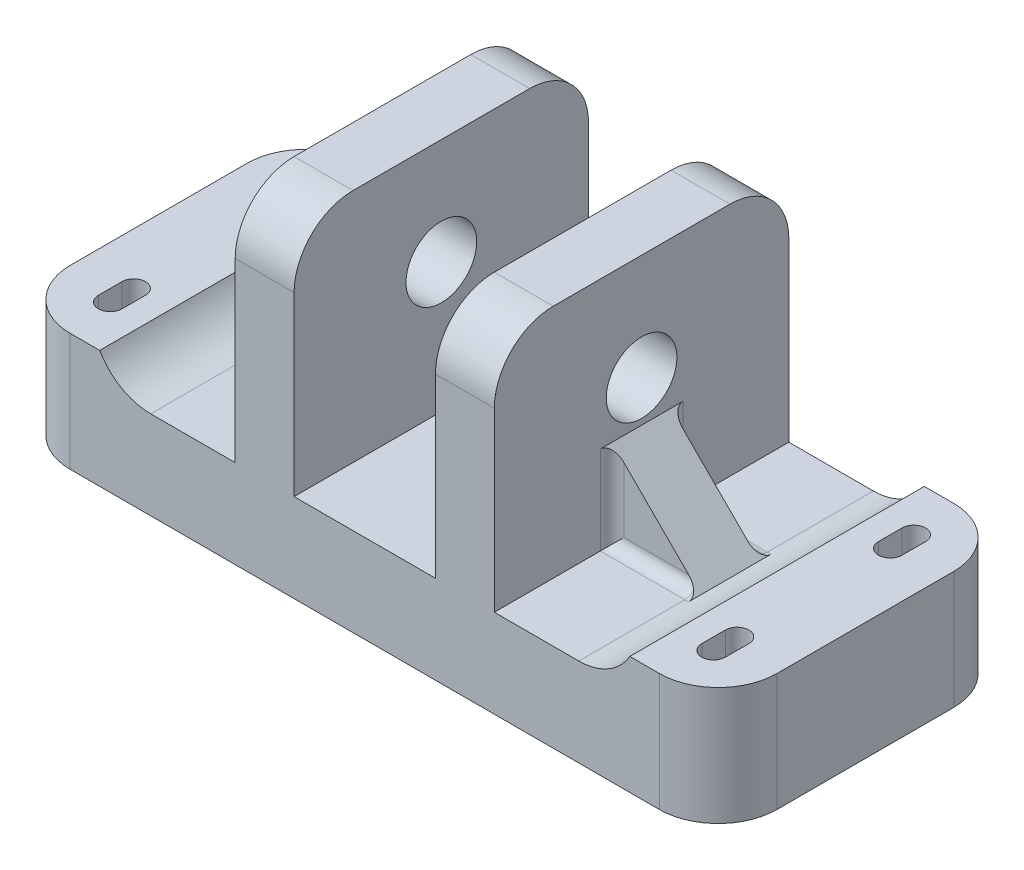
ISO-10303-21;
HEADER;
FILE_DESCRIPTION(('STEP AP214'),'2;1');
FILE_NAME('part.step','',(''),(''),'','','');
FILE_SCHEMA(('AUTOMOTIVE_DESIGN { 1 0 10303 214 1 1 1 1 }'));
ENDSEC;
DATA;
#1=APPLICATION_CONTEXT('core data for automotive mechanical design processes');
#2=APPLICATION_PROTOCOL_DEFINITION('international standard','automotive_design',2000,#1);
#3=PRODUCT_CONTEXT('',#1,'mechanical');
#4=PRODUCT('Part','Part','',(#3));
#5=PRODUCT_RELATED_PRODUCT_CATEGORY('part','',(#4));
#6=PRODUCT_DEFINITION_FORMATION('','',#4);
#7=PRODUCT_DEFINITION_CONTEXT('part definition',#1,'design');
#8=PRODUCT_DEFINITION('design','',#6,#7);
#9=PRODUCT_DEFINITION_SHAPE('','',#8);
#10=(LENGTH_UNIT() NAMED_UNIT(*) SI_UNIT(.MILLI.,.METRE.));
#11=(NAMED_UNIT(*) PLANE_ANGLE_UNIT() SI_UNIT($,.RADIAN.));
#12=(NAMED_UNIT(*) SI_UNIT($,.STERADIAN.) SOLID_ANGLE_UNIT());
#13=UNCERTAINTY_MEASURE_WITH_UNIT(LENGTH_MEASURE(1.E-05),#10,'distance_accuracy_value','');
#14=(GEOMETRIC_REPRESENTATION_CONTEXT(3) GLOBAL_UNCERTAINTY_ASSIGNED_CONTEXT((#13)) GLOBAL_UNIT_ASSIGNED_CONTEXT((#10,
#11,#12)) REPRESENTATION_CONTEXT('',''));
#15=CARTESIAN_POINT('',(0.,0.,0.));
#16=DIRECTION('',(0.,0.,1.));
#17=DIRECTION('',(1.,0.,0.));
#18=AXIS2_PLACEMENT_3D('',#15,#16,#17);
#19=CARTESIAN_POINT('',(0.,15.,0.));
#20=DIRECTION('',(0.,1.,0.));
#21=DIRECTION('',(-1.,0.,0.));
#22=AXIS2_PLACEMENT_3D('',#19,#20,#21);
#23=PLANE('',#22);
#24=DIRECTION('',(0.,0.,1.));
#25=VECTOR('',#24,1.);
#26=CARTESIAN_POINT('',(-36.3397459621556,15.,25.));
#27=LINE('',#26,#25);
#28=CARTESIAN_POINT('',(-36.3397459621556,15.,-25.));
#29=VERTEX_POINT('',#28);
#30=CARTESIAN_POINT('',(-36.3397459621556,15.,-7.));
#31=VERTEX_POINT('',#30);
#32=EDGE_CURVE('E630',#29,#31,#27,.T.);
#33=ORIENTED_EDGE('',*,*,#32,.T.);
#34=DIRECTION('',(1.,0.,0.));
#35=VECTOR('',#34,1.);
#36=CARTESIAN_POINT('',(0.,15.,-7.));
#37=LINE('',#36,#35);
#38=CARTESIAN_POINT('',(-22.,15.,-7.));
#39=VERTEX_POINT('',#38);
#40=EDGE_CURVE('E992',#31,#39,#37,.T.);
#41=ORIENTED_EDGE('',*,*,#40,.T.);
#42=DIRECTION('',(0.,0.,1.));
#43=VECTOR('',#42,1.);
#44=CARTESIAN_POINT('',(-22.,15.,-25.));
#45=LINE('',#44,#43);
#46=CARTESIAN_POINT('',(-22.,15.,-25.));
#47=VERTEX_POINT('',#46);
#48=EDGE_CURVE('E512',#47,#39,#45,.T.);
#49=ORIENTED_EDGE('',*,*,#48,.F.);
#50=DIRECTION('',(-1.,0.,0.));
#51=VECTOR('',#50,1.);
#52=CARTESIAN_POINT('',(45.,15.,-25.));
#53=LINE('',#52,#51);
#54=EDGE_CURVE('E552',#47,#29,#53,.T.);
#55=ORIENTED_EDGE('',*,*,#54,.T.);
#56=EDGE_LOOP('',(#33,#41,#49,#55));
#57=FACE_BOUND('',#56,.T.);
#58=ADVANCED_FACE('F43',(#57),#23,.T.);
#59=DIRECTION('',(0.,0.,-1.));
#60=VECTOR('',#59,1.);
#61=CARTESIAN_POINT('',(22.,15.,-25.));
#62=LINE('',#61,#60);
#63=CARTESIAN_POINT('',(22.,15.,-7.));
#64=VERTEX_POINT('',#63);
#65=CARTESIAN_POINT('',(22.,15.,-25.));
#66=VERTEX_POINT('',#65);
#67=EDGE_CURVE('E535',#64,#66,#62,.T.);
#68=ORIENTED_EDGE('',*,*,#67,.F.);
#69=DIRECTION('',(1.,0.,0.));
#70=VECTOR('',#69,1.);
#71=CARTESIAN_POINT('',(0.,15.,-7.));
#72=LINE('',#71,#70);
#73=CARTESIAN_POINT('',(36.3397459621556,15.,-7.));
#74=VERTEX_POINT('',#73);
#75=EDGE_CURVE('E1002',#64,#74,#72,.T.);
#76=ORIENTED_EDGE('',*,*,#75,.T.);
#77=DIRECTION('',(0.,0.,1.));
#78=VECTOR('',#77,1.);
#79=CARTESIAN_POINT('',(36.3397459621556,15.,-25.));
#80=LINE('',#79,#78);
#81=CARTESIAN_POINT('',(36.3397459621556,15.,-25.));
#82=VERTEX_POINT('',#81);
#83=EDGE_CURVE('E625',#74,#82,#80,.F.);
#84=ORIENTED_EDGE('',*,*,#83,.T.);
#85=EDGE_CURVE('E547',#82,#66,#53,.T.);
#86=ORIENTED_EDGE('',*,*,#85,.T.);
#87=EDGE_LOOP('',(#68,#76,#84,#86));
#88=FACE_BOUND('',#87,.T.);
#89=ADVANCED_FACE('F820',(#88),#23,.T.);
#90=CARTESIAN_POINT('',(12.,15.,-25.));
#91=VERTEX_POINT('',#90);
#92=CARTESIAN_POINT('',(-12.,15.,-25.));
#93=VERTEX_POINT('',#92);
#94=EDGE_CURVE('E551',#91,#93,#53,.T.);
#95=ORIENTED_EDGE('',*,*,#94,.T.);
#96=DIRECTION('',(0.,0.,-1.));
#97=VECTOR('',#96,1.);
#98=CARTESIAN_POINT('',(-12.,15.,-25.));
#99=LINE('',#98,#97);
#100=CARTESIAN_POINT('',(-12.,15.,25.));
#101=VERTEX_POINT('',#100);
#102=EDGE_CURVE('E515',#101,#93,#99,.T.);
#103=ORIENTED_EDGE('',*,*,#102,.F.);
#104=DIRECTION('',(-1.,0.,0.));
#105=VECTOR('',#104,1.);
#106=CARTESIAN_POINT('',(45.,15.,25.));
#107=LINE('',#106,#105);
#108=CARTESIAN_POINT('',(12.,15.,25.));
#109=VERTEX_POINT('',#108);
#110=EDGE_CURVE('E557',#109,#101,#107,.T.);
#111=ORIENTED_EDGE('',*,*,#110,.F.);
#112=DIRECTION('',(0.,0.,1.));
#113=VECTOR('',#112,1.);
#114=CARTESIAN_POINT('',(12.,15.,-25.));
#115=LINE('',#114,#113);
#116=EDGE_CURVE('E519',#91,#109,#115,.T.);
#117=ORIENTED_EDGE('',*,*,#116,.F.);
#118=EDGE_LOOP('',(#95,#103,#111,#117));
#119=FACE_BOUND('',#118,.T.);
#120=ADVANCED_FACE('F823',(#119),#23,.T.);
#121=CARTESIAN_POINT('',(-22.,15.,7.));
#122=VERTEX_POINT('',#121);
#123=CARTESIAN_POINT('',(-22.,15.,25.));
#124=VERTEX_POINT('',#123);
#125=EDGE_CURVE('E516',#122,#124,#45,.T.);
#126=ORIENTED_EDGE('',*,*,#125,.F.);
#127=DIRECTION('',(1.,0.,0.));
#128=VECTOR('',#127,1.);
#129=CARTESIAN_POINT('',(-36.3397459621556,15.,7.));
#130=LINE('',#129,#128);
#131=CARTESIAN_POINT('',(-36.3397459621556,15.,7.));
#132=VERTEX_POINT('',#131);
#133=EDGE_CURVE('E776',#122,#132,#130,.F.);
#134=ORIENTED_EDGE('',*,*,#133,.T.);
#135=CARTESIAN_POINT('',(-36.3397459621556,15.,25.));
#136=VERTEX_POINT('',#135);
#137=EDGE_CURVE('E629',#132,#136,#27,.T.);
#138=ORIENTED_EDGE('',*,*,#137,.T.);
#139=EDGE_CURVE('E550',#124,#136,#107,.T.);
#140=ORIENTED_EDGE('',*,*,#139,.F.);
#141=EDGE_LOOP('',(#126,#134,#138,#140));
#142=FACE_BOUND('',#141,.T.);
#143=ADVANCED_FACE('F828',(#142),#23,.T.);
#144=CARTESIAN_POINT('',(36.3397459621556,15.,25.));
#145=VERTEX_POINT('',#144);
#146=CARTESIAN_POINT('',(36.3397459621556,15.,7.));
#147=VERTEX_POINT('',#146);
#148=EDGE_CURVE('E626',#145,#147,#80,.F.);
#149=ORIENTED_EDGE('',*,*,#148,.T.);
#150=DIRECTION('',(1.,0.,0.));
#151=VECTOR('',#150,1.);
#152=CARTESIAN_POINT('',(22.,15.,7.));
#153=LINE('',#152,#151);
#154=CARTESIAN_POINT('',(22.,15.,7.));
#155=VERTEX_POINT('',#154);
#156=EDGE_CURVE('E720',#147,#155,#153,.F.);
#157=ORIENTED_EDGE('',*,*,#156,.T.);
#158=CARTESIAN_POINT('',(22.,15.,25.));
#159=VERTEX_POINT('',#158);
#160=EDGE_CURVE('E529',#159,#155,#62,.T.);
#161=ORIENTED_EDGE('',*,*,#160,.F.);
#162=EDGE_CURVE('E553',#145,#159,#107,.T.);
#163=ORIENTED_EDGE('',*,*,#162,.F.);
#164=EDGE_LOOP('',(#149,#157,#161,#163));
#165=FACE_BOUND('',#164,.T.);
#166=ADVANCED_FACE('F833',(#165),#23,.T.);
#167=CARTESIAN_POINT('',(60.,20.,25.));
#168=DIRECTION('',(0.,-1.,0.));
#169=DIRECTION('',(1.,0.,0.));
#170=AXIS2_PLACEMENT_3D('',#167,#168,#169);
#171=PLANE('',#170);
#172=DIRECTION('',(0.,0.,1.));
#173=VECTOR('',#172,1.);
#174=CARTESIAN_POINT('',(-53.2182411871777,20.,-17.));
#175=LINE('',#174,#173);
#176=CARTESIAN_POINT('',(-53.2182411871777,20.,-17.));
#177=VERTEX_POINT('',#176);
#178=CARTESIAN_POINT('',(-53.2182411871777,20.,-13.));
#179=VERTEX_POINT('',#178);
#180=EDGE_CURVE('E467',#177,#179,#175,.T.);
#181=ORIENTED_EDGE('',*,*,#180,.F.);
#182=CARTESIAN_POINT('',(-51.2182411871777,20.,-17.));
#183=DIRECTION('',(0.,1.,0.));
#184=DIRECTION('',(1.,0.,0.));
#185=AXIS2_PLACEMENT_3D('',#182,#183,#184);
#186=CIRCLE('',#185,2.);
#187=CARTESIAN_POINT('',(-49.2182411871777,20.,-17.));
#188=VERTEX_POINT('',#187);
#189=EDGE_CURVE('E443',#188,#177,#186,.T.);
#190=ORIENTED_EDGE('',*,*,#189,.F.);
#191=DIRECTION('',(0.,0.,-1.));
#192=VECTOR('',#191,1.);
#193=CARTESIAN_POINT('',(-49.2182411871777,20.,-17.));
#194=LINE('',#193,#192);
#195=CARTESIAN_POINT('',(-49.2182411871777,20.,-13.));
#196=VERTEX_POINT('',#195);
#197=EDGE_CURVE('E458',#196,#188,#194,.T.);
#198=ORIENTED_EDGE('',*,*,#197,.F.);
#199=CARTESIAN_POINT('',(-51.2182411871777,20.,-13.));
#200=DIRECTION('',(0.,1.,0.));
#201=DIRECTION('',(1.,0.,0.));
#202=AXIS2_PLACEMENT_3D('',#199,#200,#201);
#203=CIRCLE('',#202,2.);
#204=EDGE_CURVE('E464',#179,#196,#203,.T.);
#205=ORIENTED_EDGE('',*,*,#204,.F.);
#206=EDGE_LOOP('',(#181,#190,#198,#205));
#207=FACE_BOUND('',#206,.T.);
#208=DIRECTION('',(0.,0.,-1.));
#209=VECTOR('',#208,1.);
#210=CARTESIAN_POINT('',(-49.2182411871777,20.,17.));
#211=LINE('',#210,#209);
#212=CARTESIAN_POINT('',(-49.2182411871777,20.,17.));
#213=VERTEX_POINT('',#212);
#214=CARTESIAN_POINT('',(-49.2182411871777,20.,13.));
#215=VERTEX_POINT('',#214);
#216=EDGE_CURVE('E425',#213,#215,#211,.T.);
#217=ORIENTED_EDGE('',*,*,#216,.F.);
#218=CARTESIAN_POINT('',(-51.2182411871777,20.,17.));
#219=DIRECTION('',(0.,1.,0.));
#220=DIRECTION('',(-1.,0.,0.));
#221=AXIS2_PLACEMENT_3D('',#218,#219,#220);
#222=CIRCLE('',#221,2.);
#223=CARTESIAN_POINT('',(-53.2182411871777,20.,17.));
#224=VERTEX_POINT('',#223);
#225=EDGE_CURVE('E402',#224,#213,#222,.T.);
#226=ORIENTED_EDGE('',*,*,#225,.F.);
#227=DIRECTION('',(0.,0.,1.));
#228=VECTOR('',#227,1.);
#229=CARTESIAN_POINT('',(-53.2182411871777,20.,17.));
#230=LINE('',#229,#228);
#231=CARTESIAN_POINT('',(-53.2182411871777,20.,13.));
#232=VERTEX_POINT('',#231);
#233=EDGE_CURVE('E412',#232,#224,#230,.T.);
#234=ORIENTED_EDGE('',*,*,#233,.F.);
#235=CARTESIAN_POINT('',(-51.2182411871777,20.,13.));
#236=DIRECTION('',(0.,1.,0.));
#237=DIRECTION('',(-1.,0.,0.));
#238=AXIS2_PLACEMENT_3D('',#235,#236,#237);
#239=CIRCLE('',#238,2.);
#240=EDGE_CURVE('E418',#215,#232,#239,.T.);
#241=ORIENTED_EDGE('',*,*,#240,.F.);
#242=EDGE_LOOP('',(#217,#226,#234,#241));
#243=FACE_BOUND('',#242,.T.);
#244=DIRECTION('',(0.,0.,-1.));
#245=VECTOR('',#244,1.);
#246=CARTESIAN_POINT('',(-45.,20.,25.));
#247=LINE('',#246,#245);
#248=CARTESIAN_POINT('',(-45.,20.,25.));
#249=VERTEX_POINT('',#248);
#250=CARTESIAN_POINT('',(-45.,20.,-25.));
#251=VERTEX_POINT('',#250);
#252=EDGE_CURVE('E560',#249,#251,#247,.T.);
#253=ORIENTED_EDGE('',*,*,#252,.T.);
#254=DIRECTION('',(-1.,0.,0.));
#255=VECTOR('',#254,1.);
#256=CARTESIAN_POINT('',(60.,20.,-25.));
#257=LINE('',#256,#255);
#258=CARTESIAN_POINT('',(-50.,20.,-25.));
#259=VERTEX_POINT('',#258);
#260=EDGE_CURVE('E556',#251,#259,#257,.T.);
#261=ORIENTED_EDGE('',*,*,#260,.T.);
#262=CARTESIAN_POINT('',(-50.,20.,-15.));
#263=DIRECTION('',(0.,-1.,0.));
#264=DIRECTION('',(1.,0.,0.));
#265=AXIS2_PLACEMENT_3D('',#262,#263,#264);
#266=CIRCLE('',#265,10.);
#267=CARTESIAN_POINT('',(-60.,20.,-15.));
#268=VERTEX_POINT('',#267);
#269=EDGE_CURVE('E600',#259,#268,#266,.F.);
#270=ORIENTED_EDGE('',*,*,#269,.T.);
#271=DIRECTION('',(0.,0.,-1.));
#272=VECTOR('',#271,1.);
#273=CARTESIAN_POINT('',(-60.,20.,25.));
#274=LINE('',#273,#272);
#275=CARTESIAN_POINT('',(-60.,20.,15.));
#276=VERTEX_POINT('',#275);
#277=EDGE_CURVE('E582',#276,#268,#274,.T.);
#278=ORIENTED_EDGE('',*,*,#277,.F.);
#279=CARTESIAN_POINT('',(-50.,20.,15.));
#280=DIRECTION('',(0.,-1.,0.));
#281=DIRECTION('',(1.,0.,0.));
#282=AXIS2_PLACEMENT_3D('',#279,#280,#281);
#283=CIRCLE('',#282,10.);
#284=CARTESIAN_POINT('',(-50.,20.,25.));
#285=VERTEX_POINT('',#284);
#286=EDGE_CURVE('E597',#276,#285,#283,.F.);
#287=ORIENTED_EDGE('',*,*,#286,.T.);
#288=DIRECTION('',(-1.,0.,0.));
#289=VECTOR('',#288,1.);
#290=CARTESIAN_POINT('',(60.,20.,25.));
#291=LINE('',#290,#289);
#292=EDGE_CURVE('E567',#249,#285,#291,.T.);
#293=ORIENTED_EDGE('',*,*,#292,.F.);
#294=EDGE_LOOP('',(#253,#261,#270,#278,#287,#293));
#295=FACE_BOUND('',#294,.T.);
#296=ADVANCED_FACE('F422',(#207,#243,#295),#171,.F.);
#297=CARTESIAN_POINT('',(60.,0.,25.));
#298=DIRECTION('',(-1.,0.,0.));
#299=DIRECTION('',(0.,0.,1.));
#300=AXIS2_PLACEMENT_3D('',#297,#298,#299);
#301=PLANE('',#300);
#302=DIRECTION('',(0.,0.,-1.));
#303=VECTOR('',#302,1.);
#304=CARTESIAN_POINT('',(60.,0.,25.));
#305=LINE('',#304,#303);
#306=CARTESIAN_POINT('',(60.,0.,15.));
#307=VERTEX_POINT('',#306);
#308=CARTESIAN_POINT('',(60.,0.,-15.));
#309=VERTEX_POINT('',#308);
#310=EDGE_CURVE('E570',#307,#309,#305,.T.);
#311=ORIENTED_EDGE('',*,*,#310,.T.);
#312=DIRECTION('',(0.,1.,0.));
#313=VECTOR('',#312,1.);
#314=CARTESIAN_POINT('',(60.,0.,-15.));
#315=LINE('',#314,#313);
#316=CARTESIAN_POINT('',(60.,20.,-15.));
#317=VERTEX_POINT('',#316);
#318=EDGE_CURVE('E622',#309,#317,#315,.T.);
#319=ORIENTED_EDGE('',*,*,#318,.T.);
#320=DIRECTION('',(0.,0.,-1.));
#321=VECTOR('',#320,1.);
#322=CARTESIAN_POINT('',(60.,20.,25.));
#323=LINE('',#322,#321);
#324=CARTESIAN_POINT('',(60.,20.,15.));
#325=VERTEX_POINT('',#324);
#326=EDGE_CURVE('E585',#325,#317,#323,.T.);
#327=ORIENTED_EDGE('',*,*,#326,.F.);
#328=DIRECTION('',(0.,1.,0.));
#329=VECTOR('',#328,1.);
#330=CARTESIAN_POINT('',(60.,0.,15.));
#331=LINE('',#330,#329);
#332=EDGE_CURVE('E620',#325,#307,#331,.F.);
#333=ORIENTED_EDGE('',*,*,#332,.T.);
#334=EDGE_LOOP('',(#311,#319,#327,#333));
#335=FACE_BOUND('',#334,.T.);
#336=ADVANCED_FACE('F844',(#335),#301,.F.);
#337=DIRECTION('',(0.,0.,-1.));
#338=VECTOR('',#337,1.);
#339=CARTESIAN_POINT('',(53.2182411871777,20.,17.));
#340=LINE('',#339,#338);
#341=CARTESIAN_POINT('',(53.2182411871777,20.,17.));
#342=VERTEX_POINT('',#341);
#343=CARTESIAN_POINT('',(53.2182411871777,20.,13.));
#344=VERTEX_POINT('',#343);
#345=EDGE_CURVE('E449',#342,#344,#340,.T.);
#346=ORIENTED_EDGE('',*,*,#345,.F.);
#347=CARTESIAN_POINT('',(51.2182411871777,20.,17.));
#348=DIRECTION('',(0.,1.,0.));
#349=DIRECTION('',(1.,0.,0.));
#350=AXIS2_PLACEMENT_3D('',#347,#348,#349);
#351=CIRCLE('',#350,2.);
#352=CARTESIAN_POINT('',(49.2182411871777,20.,17.));
#353=VERTEX_POINT('',#352);
#354=EDGE_CURVE('E452',#353,#342,#351,.T.);
#355=ORIENTED_EDGE('',*,*,#354,.F.);
#356=DIRECTION('',(0.,0.,1.));
#357=VECTOR('',#356,1.);
#358=CARTESIAN_POINT('',(49.2182411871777,20.,17.));
#359=LINE('',#358,#357);
#360=CARTESIAN_POINT('',(49.2182411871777,20.,13.));
#361=VERTEX_POINT('',#360);
#362=EDGE_CURVE('E436',#361,#353,#359,.T.);
#363=ORIENTED_EDGE('',*,*,#362,.F.);
#364=CARTESIAN_POINT('',(51.2182411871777,20.,13.));
#365=DIRECTION('',(0.,1.,0.));
#366=DIRECTION('',(1.,0.,0.));
#367=AXIS2_PLACEMENT_3D('',#364,#365,#366);
#368=CIRCLE('',#367,2.);
#369=EDGE_CURVE('E446',#344,#361,#368,.T.);
#370=ORIENTED_EDGE('',*,*,#369,.F.);
#371=EDGE_LOOP('',(#346,#355,#363,#370));
#372=FACE_BOUND('',#371,.T.);
#373=DIRECTION('',(0.,0.,1.));
#374=VECTOR('',#373,1.);
#375=CARTESIAN_POINT('',(49.2182411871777,20.,-17.));
#376=LINE('',#375,#374);
#377=CARTESIAN_POINT('',(49.2182411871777,20.,-17.));
#378=VERTEX_POINT('',#377);
#379=CARTESIAN_POINT('',(49.2182411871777,20.,-13.));
#380=VERTEX_POINT('',#379);
#381=EDGE_CURVE('E472',#378,#380,#376,.T.);
#382=ORIENTED_EDGE('',*,*,#381,.F.);
#383=CARTESIAN_POINT('',(51.2182411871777,20.,-17.));
#384=DIRECTION('',(0.,1.,0.));
#385=DIRECTION('',(-1.,0.,0.));
#386=AXIS2_PLACEMENT_3D('',#383,#384,#385);
#387=CIRCLE('',#386,2.);
#388=CARTESIAN_POINT('',(53.2182411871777,20.,-17.));
#389=VERTEX_POINT('',#388);
#390=EDGE_CURVE('E454',#389,#378,#387,.T.);
#391=ORIENTED_EDGE('',*,*,#390,.F.);
#392=DIRECTION('',(0.,0.,-1.));
#393=VECTOR('',#392,1.);
#394=CARTESIAN_POINT('',(53.2182411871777,20.,-17.));
#395=LINE('',#394,#393);
#396=CARTESIAN_POINT('',(53.2182411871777,20.,-13.));
#397=VERTEX_POINT('',#396);
#398=EDGE_CURVE('E478',#397,#389,#395,.T.);
#399=ORIENTED_EDGE('',*,*,#398,.F.);
#400=CARTESIAN_POINT('',(51.2182411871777,20.,-13.));
#401=DIRECTION('',(0.,1.,0.));
#402=DIRECTION('',(-1.,0.,0.));
#403=AXIS2_PLACEMENT_3D('',#400,#401,#402);
#404=CIRCLE('',#403,2.);
#405=EDGE_CURVE('E475',#380,#397,#404,.T.);
#406=ORIENTED_EDGE('',*,*,#405,.F.);
#407=EDGE_LOOP('',(#382,#391,#399,#406));
#408=FACE_BOUND('',#407,.T.);
#409=CARTESIAN_POINT('',(50.,20.,-25.));
#410=VERTEX_POINT('',#409);
#411=CARTESIAN_POINT('',(45.,20.,-25.));
#412=VERTEX_POINT('',#411);
#413=EDGE_CURVE('E571',#410,#412,#257,.T.);
#414=ORIENTED_EDGE('',*,*,#413,.T.);
#415=DIRECTION('',(0.,0.,-1.));
#416=VECTOR('',#415,1.);
#417=CARTESIAN_POINT('',(45.,20.,25.));
#418=LINE('',#417,#416);
#419=CARTESIAN_POINT('',(45.,20.,25.));
#420=VERTEX_POINT('',#419);
#421=EDGE_CURVE('E546',#420,#412,#418,.T.);
#422=ORIENTED_EDGE('',*,*,#421,.F.);
#423=CARTESIAN_POINT('',(50.,20.,25.));
#424=VERTEX_POINT('',#423);
#425=EDGE_CURVE('E563',#424,#420,#291,.T.);
#426=ORIENTED_EDGE('',*,*,#425,.F.);
#427=CARTESIAN_POINT('',(50.,20.,15.));
#428=DIRECTION('',(0.,-1.,0.));
#429=DIRECTION('',(1.,0.,0.));
#430=AXIS2_PLACEMENT_3D('',#427,#428,#429);
#431=CIRCLE('',#430,10.);
#432=EDGE_CURVE('E593',#424,#325,#431,.F.);
#433=ORIENTED_EDGE('',*,*,#432,.T.);
#434=ORIENTED_EDGE('',*,*,#326,.T.);
#435=CARTESIAN_POINT('',(50.,20.,-15.));
#436=DIRECTION('',(0.,-1.,0.));
#437=DIRECTION('',(1.,0.,0.));
#438=AXIS2_PLACEMENT_3D('',#435,#436,#437);
#439=CIRCLE('',#438,10.);
#440=EDGE_CURVE('E595',#317,#410,#439,.F.);
#441=ORIENTED_EDGE('',*,*,#440,.T.);
#442=EDGE_LOOP('',(#414,#422,#426,#433,#434,#441));
#443=FACE_BOUND('',#442,.T.);
#444=ADVANCED_FACE('F847',(#372,#408,#443),#171,.F.);
#445=CARTESIAN_POINT('',(-60.,0.,25.));
#446=DIRECTION('',(-1.,0.,0.));
#447=DIRECTION('',(0.,-1.,0.));
#448=AXIS2_PLACEMENT_3D('',#445,#446,#447);
#449=PLANE('',#448);
#450=ORIENTED_EDGE('',*,*,#277,.T.);
#451=DIRECTION('',(0.,1.,0.));
#452=VECTOR('',#451,1.);
#453=CARTESIAN_POINT('',(-60.,0.,-15.));
#454=LINE('',#453,#452);
#455=CARTESIAN_POINT('',(-60.,0.,-15.));
#456=VERTEX_POINT('',#455);
#457=EDGE_CURVE('E605',#268,#456,#454,.F.);
#458=ORIENTED_EDGE('',*,*,#457,.T.);
#459=DIRECTION('',(0.,0.,-1.));
#460=VECTOR('',#459,1.);
#461=CARTESIAN_POINT('',(-60.,0.,25.));
#462=LINE('',#461,#460);
#463=CARTESIAN_POINT('',(-60.,0.,15.));
#464=VERTEX_POINT('',#463);
#465=EDGE_CURVE('E579',#464,#456,#462,.T.);
#466=ORIENTED_EDGE('',*,*,#465,.F.);
#467=DIRECTION('',(0.,1.,0.));
#468=VECTOR('',#467,1.);
#469=CARTESIAN_POINT('',(-60.,0.,15.));
#470=LINE('',#469,#468);
#471=EDGE_CURVE('E602',#464,#276,#470,.T.);
#472=ORIENTED_EDGE('',*,*,#471,.T.);
#473=EDGE_LOOP('',(#450,#458,#466,#472));
#474=FACE_BOUND('',#473,.T.);
#475=ADVANCED_FACE('F941',(#474),#449,.T.);
#476=CARTESIAN_POINT('',(60.,0.,25.));
#477=DIRECTION('',(0.,-1.,0.));
#478=DIRECTION('',(1.,0.,0.));
#479=AXIS2_PLACEMENT_3D('',#476,#477,#478);
#480=PLANE('',#479);
#481=CARTESIAN_POINT('',(51.2182411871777,0.,17.));
#482=DIRECTION('',(0.,-1.,0.));
#483=DIRECTION('',(1.,0.,0.));
#484=AXIS2_PLACEMENT_3D('',#481,#482,#483);
#485=CIRCLE('',#484,2.);
#486=CARTESIAN_POINT('',(53.2182411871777,0.,17.));
#487=VERTEX_POINT('',#486);
#488=CARTESIAN_POINT('',(49.2182411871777,0.,17.));
#489=VERTEX_POINT('',#488);
#490=EDGE_CURVE('E711',#487,#489,#485,.T.);
#491=ORIENTED_EDGE('',*,*,#490,.F.);
#492=DIRECTION('',(0.,0.,1.));
#493=VECTOR('',#492,1.);
#494=CARTESIAN_POINT('',(53.2182411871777,0.,25.));
#495=LINE('',#494,#493);
#496=CARTESIAN_POINT('',(53.2182411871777,0.,13.));
#497=VERTEX_POINT('',#496);
#498=EDGE_CURVE('E704',#497,#487,#495,.T.);
#499=ORIENTED_EDGE('',*,*,#498,.F.);
#500=CARTESIAN_POINT('',(51.2182411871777,0.,13.));
#501=DIRECTION('',(0.,-1.,0.));
#502=DIRECTION('',(1.,0.,0.));
#503=AXIS2_PLACEMENT_3D('',#500,#501,#502);
#504=CIRCLE('',#503,2.);
#505=CARTESIAN_POINT('',(49.2182411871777,0.,13.));
#506=VERTEX_POINT('',#505);
#507=EDGE_CURVE('E706',#506,#497,#504,.T.);
#508=ORIENTED_EDGE('',*,*,#507,.F.);
#509=DIRECTION('',(0.,0.,-1.));
#510=VECTOR('',#509,1.);
#511=CARTESIAN_POINT('',(49.2182411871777,0.,25.));
#512=LINE('',#511,#510);
#513=EDGE_CURVE('E709',#489,#506,#512,.T.);
#514=ORIENTED_EDGE('',*,*,#513,.F.);
#515=EDGE_LOOP('',(#491,#499,#508,#514));
#516=FACE_BOUND('',#515,.T.);
#517=CARTESIAN_POINT('',(-51.2182411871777,0.,-17.));
#518=DIRECTION('',(0.,-1.,0.));
#519=DIRECTION('',(1.,0.,0.));
#520=AXIS2_PLACEMENT_3D('',#517,#518,#519);
#521=CIRCLE('',#520,2.);
#522=CARTESIAN_POINT('',(-53.2182411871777,0.,-17.));
#523=VERTEX_POINT('',#522);
#524=CARTESIAN_POINT('',(-49.2182411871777,0.,-17.));
#525=VERTEX_POINT('',#524);
#526=EDGE_CURVE('E702',#523,#525,#521,.T.);
#527=ORIENTED_EDGE('',*,*,#526,.F.);
#528=DIRECTION('',(0.,0.,-1.));
#529=VECTOR('',#528,1.);
#530=CARTESIAN_POINT('',(-53.2182411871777,0.,25.));
#531=LINE('',#530,#529);
#532=CARTESIAN_POINT('',(-53.2182411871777,0.,-13.));
#533=VERTEX_POINT('',#532);
#534=EDGE_CURVE('E695',#533,#523,#531,.T.);
#535=ORIENTED_EDGE('',*,*,#534,.F.);
#536=CARTESIAN_POINT('',(-51.2182411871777,0.,-13.));
#537=DIRECTION('',(0.,-1.,0.));
#538=DIRECTION('',(1.,0.,0.));
#539=AXIS2_PLACEMENT_3D('',#536,#537,#538);
#540=CIRCLE('',#539,2.);
#541=CARTESIAN_POINT('',(-49.2182411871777,0.,-13.));
#542=VERTEX_POINT('',#541);
#543=EDGE_CURVE('E697',#542,#533,#540,.T.);
#544=ORIENTED_EDGE('',*,*,#543,.F.);
#545=DIRECTION('',(0.,0.,1.));
#546=VECTOR('',#545,1.);
#547=CARTESIAN_POINT('',(-49.2182411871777,0.,25.));
#548=LINE('',#547,#546);
#549=EDGE_CURVE('E700',#525,#542,#548,.T.);
#550=ORIENTED_EDGE('',*,*,#549,.F.);
#551=EDGE_LOOP('',(#527,#535,#544,#550));
#552=FACE_BOUND('',#551,.T.);
#553=CARTESIAN_POINT('',(-51.2182411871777,0.,17.));
#554=DIRECTION('',(0.,-1.,0.));
#555=DIRECTION('',(1.,0.,0.));
#556=AXIS2_PLACEMENT_3D('',#553,#554,#555);
#557=CIRCLE('',#556,2.);
#558=CARTESIAN_POINT('',(-49.2182411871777,0.,17.));
#559=VERTEX_POINT('',#558);
#560=CARTESIAN_POINT('',(-53.2182411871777,0.,17.));
#561=VERTEX_POINT('',#560);
#562=EDGE_CURVE('E405',#559,#561,#557,.T.);
#563=ORIENTED_EDGE('',*,*,#562,.F.);
#564=DIRECTION('',(0.,0.,1.));
#565=VECTOR('',#564,1.);
#566=CARTESIAN_POINT('',(-49.2182411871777,0.,25.));
#567=LINE('',#566,#565);
#568=CARTESIAN_POINT('',(-49.2182411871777,0.,13.));
#569=VERTEX_POINT('',#568);
#570=EDGE_CURVE('E687',#569,#559,#567,.T.);
#571=ORIENTED_EDGE('',*,*,#570,.F.);
#572=CARTESIAN_POINT('',(-51.2182411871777,0.,13.));
#573=DIRECTION('',(0.,-1.,0.));
#574=DIRECTION('',(1.,0.,0.));
#575=AXIS2_PLACEMENT_3D('',#572,#573,#574);
#576=CIRCLE('',#575,2.);
#577=CARTESIAN_POINT('',(-53.2182411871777,0.,13.));
#578=VERTEX_POINT('',#577);
#579=EDGE_CURVE('E689',#578,#569,#576,.T.);
#580=ORIENTED_EDGE('',*,*,#579,.F.);
#581=DIRECTION('',(0.,0.,-1.));
#582=VECTOR('',#581,1.);
#583=CARTESIAN_POINT('',(-53.2182411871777,0.,25.));
#584=LINE('',#583,#582);
#585=EDGE_CURVE('E692',#561,#578,#584,.T.);
#586=ORIENTED_EDGE('',*,*,#585,.F.);
#587=EDGE_LOOP('',(#563,#571,#580,#586));
#588=FACE_BOUND('',#587,.T.);
#589=CARTESIAN_POINT('',(51.2182411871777,0.,-17.));
#590=DIRECTION('',(0.,-1.,0.));
#591=DIRECTION('',(1.,0.,0.));
#592=AXIS2_PLACEMENT_3D('',#589,#590,#591);
#593=CIRCLE('',#592,2.);
#594=CARTESIAN_POINT('',(49.2182411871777,0.,-17.));
#595=VERTEX_POINT('',#594);
#596=CARTESIAN_POINT('',(53.2182411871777,0.,-17.));
#597=VERTEX_POINT('',#596);
#598=EDGE_CURVE('E685',#595,#597,#593,.T.);
#599=ORIENTED_EDGE('',*,*,#598,.F.);
#600=DIRECTION('',(0.,0.,-1.));
#601=VECTOR('',#600,1.);
#602=CARTESIAN_POINT('',(49.2182411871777,0.,25.));
#603=LINE('',#602,#601);
#604=CARTESIAN_POINT('',(49.2182411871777,0.,-13.));
#605=VERTEX_POINT('',#604);
#606=EDGE_CURVE('E678',#605,#595,#603,.T.);
#607=ORIENTED_EDGE('',*,*,#606,.F.);
#608=CARTESIAN_POINT('',(51.2182411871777,0.,-13.));
#609=DIRECTION('',(0.,-1.,0.));
#610=DIRECTION('',(1.,0.,0.));
#611=AXIS2_PLACEMENT_3D('',#608,#609,#610);
#612=CIRCLE('',#611,2.);
#613=CARTESIAN_POINT('',(53.2182411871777,0.,-13.));
#614=VERTEX_POINT('',#613);
#615=EDGE_CURVE('E680',#614,#605,#612,.T.);
#616=ORIENTED_EDGE('',*,*,#615,.F.);
#617=DIRECTION('',(0.,0.,1.));
#618=VECTOR('',#617,1.);
#619=CARTESIAN_POINT('',(53.2182411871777,0.,25.));
#620=LINE('',#619,#618);
#621=EDGE_CURVE('E683',#597,#614,#620,.T.);
#622=ORIENTED_EDGE('',*,*,#621,.F.);
#623=EDGE_LOOP('',(#599,#607,#616,#622));
#624=FACE_BOUND('',#623,.T.);
#625=ORIENTED_EDGE('',*,*,#465,.T.);
#626=CARTESIAN_POINT('',(-50.,0.,-15.));
#627=DIRECTION('',(0.,-1.,0.));
#628=DIRECTION('',(1.,0.,0.));
#629=AXIS2_PLACEMENT_3D('',#626,#627,#628);
#630=CIRCLE('',#629,10.);
#631=CARTESIAN_POINT('',(-50.,0.,-25.));
#632=VERTEX_POINT('',#631);
#633=EDGE_CURVE('E613',#456,#632,#630,.T.);
#634=ORIENTED_EDGE('',*,*,#633,.T.);
#635=DIRECTION('',(-1.,0.,0.));
#636=VECTOR('',#635,1.);
#637=CARTESIAN_POINT('',(60.,0.,-25.));
#638=LINE('',#637,#636);
#639=CARTESIAN_POINT('',(50.,0.,-25.));
#640=VERTEX_POINT('',#639);
#641=EDGE_CURVE('E574',#640,#632,#638,.T.);
#642=ORIENTED_EDGE('',*,*,#641,.F.);
#643=CARTESIAN_POINT('',(50.,0.,-15.));
#644=DIRECTION('',(0.,-1.,0.));
#645=DIRECTION('',(1.,0.,0.));
#646=AXIS2_PLACEMENT_3D('',#643,#644,#645);
#647=CIRCLE('',#646,10.);
#648=EDGE_CURVE('E609',#640,#309,#647,.T.);
#649=ORIENTED_EDGE('',*,*,#648,.T.);
#650=ORIENTED_EDGE('',*,*,#310,.F.);
#651=CARTESIAN_POINT('',(50.,0.,15.));
#652=DIRECTION('',(0.,-1.,0.));
#653=DIRECTION('',(1.,0.,0.));
#654=AXIS2_PLACEMENT_3D('',#651,#652,#653);
#655=CIRCLE('',#654,10.);
#656=CARTESIAN_POINT('',(50.,0.,25.));
#657=VERTEX_POINT('',#656);
#658=EDGE_CURVE('E607',#307,#657,#655,.T.);
#659=ORIENTED_EDGE('',*,*,#658,.T.);
#660=DIRECTION('',(-1.,0.,0.));
#661=VECTOR('',#660,1.);
#662=CARTESIAN_POINT('',(60.,0.,25.));
#663=LINE('',#662,#661);
#664=CARTESIAN_POINT('',(-50.,0.,25.));
#665=VERTEX_POINT('',#664);
#666=EDGE_CURVE('E566',#657,#665,#663,.T.);
#667=ORIENTED_EDGE('',*,*,#666,.T.);
#668=CARTESIAN_POINT('',(-50.,0.,15.));
#669=DIRECTION('',(0.,-1.,0.));
#670=DIRECTION('',(1.,0.,0.));
#671=AXIS2_PLACEMENT_3D('',#668,#669,#670);
#672=CIRCLE('',#671,10.);
#673=EDGE_CURVE('E611',#665,#464,#672,.T.);
#674=ORIENTED_EDGE('',*,*,#673,.T.);
#675=EDGE_LOOP('',(#625,#634,#642,#649,#650,#659,#667,#674));
#676=FACE_BOUND('',#675,.T.);
#677=ADVANCED_FACE('F937',(#516,#552,#588,#624,#676),#480,.T.);
#678=CARTESIAN_POINT('',(0.,0.,25.));
#679=DIRECTION('',(0.,0.,1.));
#680=DIRECTION('',(1.,0.,0.));
#681=AXIS2_PLACEMENT_3D('',#678,#679,#680);
#682=PLANE('',#681);
#683=DIRECTION('',(0.,-1.,0.));
#684=VECTOR('',#683,1.);
#685=CARTESIAN_POINT('',(-12.,55.,25.));
#686=LINE('',#685,#684);
#687=CARTESIAN_POINT('',(-12.,45.,25.));
#688=VERTEX_POINT('',#687);
#689=EDGE_CURVE('E509',#688,#101,#686,.T.);
#690=ORIENTED_EDGE('',*,*,#689,.F.);
#691=DIRECTION('',(1.,0.,0.));
#692=VECTOR('',#691,1.);
#693=CARTESIAN_POINT('',(-22.,45.,25.));
#694=LINE('',#693,#692);
#695=CARTESIAN_POINT('',(-22.,45.,25.));
#696=VERTEX_POINT('',#695);
#697=EDGE_CURVE('E662',#688,#696,#694,.F.);
#698=ORIENTED_EDGE('',*,*,#697,.T.);
#699=DIRECTION('',(0.,-1.,0.));
#700=VECTOR('',#699,1.);
#701=CARTESIAN_POINT('',(-22.,55.,25.));
#702=LINE('',#701,#700);
#703=EDGE_CURVE('E506',#696,#124,#702,.T.);
#704=ORIENTED_EDGE('',*,*,#703,.T.);
#705=ORIENTED_EDGE('',*,*,#139,.T.);
#706=CARTESIAN_POINT('',(-36.3397459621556,25.,25.));
#707=DIRECTION('',(0.,0.,1.));
#708=DIRECTION('',(1.,0.,0.));
#709=AXIS2_PLACEMENT_3D('',#706,#707,#708);
#710=CIRCLE('',#709,10.);
#711=EDGE_CURVE('E636',#136,#249,#710,.F.);
#712=ORIENTED_EDGE('',*,*,#711,.T.);
#713=ORIENTED_EDGE('',*,*,#292,.T.);
#714=DIRECTION('',(0.,1.,0.));
#715=VECTOR('',#714,1.);
#716=CARTESIAN_POINT('',(-50.,0.,25.));
#717=LINE('',#716,#715);
#718=EDGE_CURVE('E618',#285,#665,#717,.F.);
#719=ORIENTED_EDGE('',*,*,#718,.T.);
#720=ORIENTED_EDGE('',*,*,#666,.F.);
#721=DIRECTION('',(0.,1.,0.));
#722=VECTOR('',#721,1.);
#723=CARTESIAN_POINT('',(50.,20.,25.));
#724=LINE('',#723,#722);
#725=EDGE_CURVE('E615',#657,#424,#724,.T.);
#726=ORIENTED_EDGE('',*,*,#725,.T.);
#727=ORIENTED_EDGE('',*,*,#425,.T.);
#728=CARTESIAN_POINT('',(36.3397459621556,25.,25.));
#729=DIRECTION('',(0.,0.,1.));
#730=DIRECTION('',(1.,0.,0.));
#731=AXIS2_PLACEMENT_3D('',#728,#729,#730);
#732=CIRCLE('',#731,10.);
#733=EDGE_CURVE('E640',#420,#145,#732,.F.);
#734=ORIENTED_EDGE('',*,*,#733,.T.);
#735=ORIENTED_EDGE('',*,*,#162,.T.);
#736=DIRECTION('',(0.,-1.,0.));
#737=VECTOR('',#736,1.);
#738=CARTESIAN_POINT('',(22.,55.,25.));
#739=LINE('',#738,#737);
#740=CARTESIAN_POINT('',(22.,45.,25.));
#741=VERTEX_POINT('',#740);
#742=EDGE_CURVE('E542',#741,#159,#739,.T.);
#743=ORIENTED_EDGE('',*,*,#742,.F.);
#744=DIRECTION('',(1.,0.,0.));
#745=VECTOR('',#744,1.);
#746=CARTESIAN_POINT('',(0.,45.,25.));
#747=LINE('',#746,#745);
#748=CARTESIAN_POINT('',(12.,45.,25.));
#749=VERTEX_POINT('',#748);
#750=EDGE_CURVE('E660',#741,#749,#747,.F.);
#751=ORIENTED_EDGE('',*,*,#750,.T.);
#752=DIRECTION('',(0.,-1.,0.));
#753=VECTOR('',#752,1.);
#754=CARTESIAN_POINT('',(12.,55.,25.));
#755=LINE('',#754,#753);
#756=EDGE_CURVE('E544',#749,#109,#755,.T.);
#757=ORIENTED_EDGE('',*,*,#756,.T.);
#758=ORIENTED_EDGE('',*,*,#110,.T.);
#759=EDGE_LOOP('',(#690,#698,#704,#705,#712,#713,#719,#720,#726,#727,#734,#735,#743,#751,#757,#758));
#760=FACE_BOUND('',#759,.T.);
#761=ADVANCED_FACE('F940',(#760),#682,.T.);
#762=CARTESIAN_POINT('',(0.,0.,-25.));
#763=DIRECTION('',(0.,0.,1.));
#764=DIRECTION('',(1.,0.,0.));
#765=AXIS2_PLACEMENT_3D('',#762,#763,#764);
#766=PLANE('',#765);
#767=DIRECTION('',(0.,-1.,0.));
#768=VECTOR('',#767,1.);
#769=CARTESIAN_POINT('',(-22.,55.,-25.));
#770=LINE('',#769,#768);
#771=CARTESIAN_POINT('',(-22.,45.,-25.));
#772=VERTEX_POINT('',#771);
#773=EDGE_CURVE('E504',#772,#47,#770,.T.);
#774=ORIENTED_EDGE('',*,*,#773,.F.);
#775=DIRECTION('',(-1.,0.,0.));
#776=VECTOR('',#775,1.);
#777=CARTESIAN_POINT('',(0.,45.,-25.));
#778=LINE('',#777,#776);
#779=CARTESIAN_POINT('',(-12.,45.,-25.));
#780=VERTEX_POINT('',#779);
#781=EDGE_CURVE('E654',#772,#780,#778,.F.);
#782=ORIENTED_EDGE('',*,*,#781,.T.);
#783=DIRECTION('',(0.,-1.,0.));
#784=VECTOR('',#783,1.);
#785=CARTESIAN_POINT('',(-12.,55.,-25.));
#786=LINE('',#785,#784);
#787=EDGE_CURVE('E502',#780,#93,#786,.T.);
#788=ORIENTED_EDGE('',*,*,#787,.T.);
#789=ORIENTED_EDGE('',*,*,#94,.F.);
#790=DIRECTION('',(0.,-1.,0.));
#791=VECTOR('',#790,1.);
#792=CARTESIAN_POINT('',(12.,55.,-25.));
#793=LINE('',#792,#791);
#794=CARTESIAN_POINT('',(12.,45.,-25.));
#795=VERTEX_POINT('',#794);
#796=EDGE_CURVE('E532',#795,#91,#793,.T.);
#797=ORIENTED_EDGE('',*,*,#796,.F.);
#798=DIRECTION('',(-1.,0.,0.));
#799=VECTOR('',#798,1.);
#800=CARTESIAN_POINT('',(22.,45.,-25.));
#801=LINE('',#800,#799);
#802=CARTESIAN_POINT('',(22.,45.,-25.));
#803=VERTEX_POINT('',#802);
#804=EDGE_CURVE('E652',#795,#803,#801,.F.);
#805=ORIENTED_EDGE('',*,*,#804,.T.);
#806=DIRECTION('',(0.,-1.,0.));
#807=VECTOR('',#806,1.);
#808=CARTESIAN_POINT('',(22.,55.,-25.));
#809=LINE('',#808,#807);
#810=EDGE_CURVE('E539',#803,#66,#809,.T.);
#811=ORIENTED_EDGE('',*,*,#810,.T.);
#812=ORIENTED_EDGE('',*,*,#85,.F.);
#813=CARTESIAN_POINT('',(36.3397459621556,25.,-25.));
#814=DIRECTION('',(0.,0.,1.));
#815=DIRECTION('',(1.,0.,0.));
#816=AXIS2_PLACEMENT_3D('',#813,#814,#815);
#817=CIRCLE('',#816,10.);
#818=EDGE_CURVE('E638',#82,#412,#817,.T.);
#819=ORIENTED_EDGE('',*,*,#818,.T.);
#820=ORIENTED_EDGE('',*,*,#413,.F.);
#821=DIRECTION('',(0.,1.,0.));
#822=VECTOR('',#821,1.);
#823=CARTESIAN_POINT('',(50.,0.,-25.));
#824=LINE('',#823,#822);
#825=EDGE_CURVE('E588',#410,#640,#824,.F.);
#826=ORIENTED_EDGE('',*,*,#825,.T.);
#827=ORIENTED_EDGE('',*,*,#641,.T.);
#828=DIRECTION('',(0.,1.,0.));
#829=VECTOR('',#828,1.);
#830=CARTESIAN_POINT('',(-50.,20.,-25.));
#831=LINE('',#830,#829);
#832=EDGE_CURVE('E590',#632,#259,#831,.T.);
#833=ORIENTED_EDGE('',*,*,#832,.T.);
#834=ORIENTED_EDGE('',*,*,#260,.F.);
#835=CARTESIAN_POINT('',(-36.3397459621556,25.,-25.));
#836=DIRECTION('',(0.,0.,1.));
#837=DIRECTION('',(1.,0.,0.));
#838=AXIS2_PLACEMENT_3D('',#835,#836,#837);
#839=CIRCLE('',#838,10.);
#840=EDGE_CURVE('E633',#251,#29,#839,.T.);
#841=ORIENTED_EDGE('',*,*,#840,.T.);
#842=ORIENTED_EDGE('',*,*,#54,.F.);
#843=EDGE_LOOP('',(#774,#782,#788,#789,#797,#805,#811,#812,#819,#820,#826,#827,#833,#834,#841,#842));
#844=FACE_BOUND('',#843,.T.);
#845=ADVANCED_FACE('F962',(#844),#766,.F.);
#846=CARTESIAN_POINT('',(-50.,0.,-15.));
#847=DIRECTION('',(0.,-1.,0.));
#848=DIRECTION('',(1.,0.,0.));
#849=AXIS2_PLACEMENT_3D('',#846,#847,#848);
#850=CYLINDRICAL_SURFACE('',#849,10.);
#851=ORIENTED_EDGE('',*,*,#633,.F.);
#852=ORIENTED_EDGE('',*,*,#457,.F.);
#853=ORIENTED_EDGE('',*,*,#269,.F.);
#854=ORIENTED_EDGE('',*,*,#832,.F.);
#855=EDGE_LOOP('',(#851,#852,#853,#854));
#856=FACE_BOUND('',#855,.T.);
#857=ADVANCED_FACE('F957',(#856),#850,.T.);
#858=CARTESIAN_POINT('',(-50.,0.,15.));
#859=DIRECTION('',(0.,1.,0.));
#860=DIRECTION('',(-1.,0.,0.));
#861=AXIS2_PLACEMENT_3D('',#858,#859,#860);
#862=CYLINDRICAL_SURFACE('',#861,10.);
#863=ORIENTED_EDGE('',*,*,#673,.F.);
#864=ORIENTED_EDGE('',*,*,#718,.F.);
#865=ORIENTED_EDGE('',*,*,#286,.F.);
#866=ORIENTED_EDGE('',*,*,#471,.F.);
#867=EDGE_LOOP('',(#863,#864,#865,#866));
#868=FACE_BOUND('',#867,.T.);
#869=ADVANCED_FACE('F984',(#868),#862,.T.);
#870=CARTESIAN_POINT('',(50.,0.,-15.));
#871=DIRECTION('',(0.,1.,0.));
#872=DIRECTION('',(0.,0.,1.));
#873=AXIS2_PLACEMENT_3D('',#870,#871,#872);
#874=CYLINDRICAL_SURFACE('',#873,10.);
#875=ORIENTED_EDGE('',*,*,#648,.F.);
#876=ORIENTED_EDGE('',*,*,#825,.F.);
#877=ORIENTED_EDGE('',*,*,#440,.F.);
#878=ORIENTED_EDGE('',*,*,#318,.F.);
#879=EDGE_LOOP('',(#875,#876,#877,#878));
#880=FACE_BOUND('',#879,.T.);
#881=ADVANCED_FACE('F969',(#880),#874,.T.);
#882=CARTESIAN_POINT('',(50.,0.,15.));
#883=DIRECTION('',(0.,-1.,0.));
#884=DIRECTION('',(0.,0.,-1.));
#885=AXIS2_PLACEMENT_3D('',#882,#883,#884);
#886=CYLINDRICAL_SURFACE('',#885,10.);
#887=ORIENTED_EDGE('',*,*,#658,.F.);
#888=ORIENTED_EDGE('',*,*,#332,.F.);
#889=ORIENTED_EDGE('',*,*,#432,.F.);
#890=ORIENTED_EDGE('',*,*,#725,.F.);
#891=EDGE_LOOP('',(#887,#888,#889,#890));
#892=FACE_BOUND('',#891,.T.);
#893=ADVANCED_FACE('F978',(#892),#886,.T.);
#894=CARTESIAN_POINT('',(-36.3397459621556,25.,25.));
#895=DIRECTION('',(0.,0.,-1.));
#896=DIRECTION('',(-1.,0.,0.));
#897=AXIS2_PLACEMENT_3D('',#894,#895,#896);
#898=CYLINDRICAL_SURFACE('',#897,10.);
#899=DIRECTION('',(0.,0.,-1.));
#900=VECTOR('',#899,1.);
#901=CARTESIAN_POINT('',(-36.979513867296,15.020486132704,25.));
#902=LINE('',#901,#900);
#903=CARTESIAN_POINT('',(-36.979513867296,15.020486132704,-7.));
#904=VERTEX_POINT('',#903);
#905=CARTESIAN_POINT('',(-36.979513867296,15.020486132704,7.));
#906=VERTEX_POINT('',#905);
#907=EDGE_CURVE('E909',#904,#906,#902,.F.);
#908=ORIENTED_EDGE('',*,*,#907,.F.);
#909=CARTESIAN_POINT('',(-36.3397459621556,25.,-7.));
#910=DIRECTION('',(0.,0.,1.));
#911=DIRECTION('',(1.,0.,0.));
#912=AXIS2_PLACEMENT_3D('',#909,#910,#911);
#913=CIRCLE('',#912,10.);
#914=EDGE_CURVE('E1025',#904,#31,#913,.T.);
#915=ORIENTED_EDGE('',*,*,#914,.T.);
#916=ORIENTED_EDGE('',*,*,#32,.F.);
#917=ORIENTED_EDGE('',*,*,#840,.F.);
#918=ORIENTED_EDGE('',*,*,#252,.F.);
#919=ORIENTED_EDGE('',*,*,#711,.F.);
#920=ORIENTED_EDGE('',*,*,#137,.F.);
#921=CARTESIAN_POINT('',(-36.3397459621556,25.,7.));
#922=DIRECTION('',(0.,0.,1.));
#923=DIRECTION('',(1.,0.,0.));
#924=AXIS2_PLACEMENT_3D('',#921,#922,#923);
#925=CIRCLE('',#924,10.);
#926=EDGE_CURVE('E875',#132,#906,#925,.F.);
#927=ORIENTED_EDGE('',*,*,#926,.T.);
#928=EDGE_LOOP('',(#908,#915,#916,#917,#918,#919,#920,#927));
#929=FACE_BOUND('',#928,.T.);
#930=ADVANCED_FACE('F896',(#929),#898,.F.);
#931=CARTESIAN_POINT('',(36.3397459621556,25.,25.));
#932=DIRECTION('',(0.,0.,-1.));
#933=DIRECTION('',(-1.,0.,0.));
#934=AXIS2_PLACEMENT_3D('',#931,#932,#933);
#935=CYLINDRICAL_SURFACE('',#934,10.);
#936=ORIENTED_EDGE('',*,*,#83,.F.);
#937=CARTESIAN_POINT('',(36.3397459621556,25.,-7.));
#938=DIRECTION('',(0.,0.,1.));
#939=DIRECTION('',(1.,0.,0.));
#940=AXIS2_PLACEMENT_3D('',#937,#938,#939);
#941=CIRCLE('',#940,10.);
#942=CARTESIAN_POINT('',(36.979513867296,15.0204861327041,-7.));
#943=VERTEX_POINT('',#942);
#944=EDGE_CURVE('E1029',#74,#943,#941,.T.);
#945=ORIENTED_EDGE('',*,*,#944,.T.);
#946=DIRECTION('',(0.,0.,-1.));
#947=VECTOR('',#946,1.);
#948=CARTESIAN_POINT('',(36.979513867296,15.0204861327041,25.));
#949=LINE('',#948,#947);
#950=CARTESIAN_POINT('',(36.979513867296,15.0204861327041,7.));
#951=VERTEX_POINT('',#950);
#952=EDGE_CURVE('E409',#951,#943,#949,.T.);
#953=ORIENTED_EDGE('',*,*,#952,.F.);
#954=CARTESIAN_POINT('',(36.3397459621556,25.,7.));
#955=DIRECTION('',(0.,0.,1.));
#956=DIRECTION('',(1.,0.,0.));
#957=AXIS2_PLACEMENT_3D('',#954,#955,#956);
#958=CIRCLE('',#957,10.);
#959=EDGE_CURVE('E713',#951,#147,#958,.F.);
#960=ORIENTED_EDGE('',*,*,#959,.T.);
#961=ORIENTED_EDGE('',*,*,#148,.F.);
#962=ORIENTED_EDGE('',*,*,#733,.F.);
#963=ORIENTED_EDGE('',*,*,#421,.T.);
#964=ORIENTED_EDGE('',*,*,#818,.F.);
#965=EDGE_LOOP('',(#936,#945,#953,#960,#961,#962,#963,#964));
#966=FACE_BOUND('',#965,.T.);
#967=ADVANCED_FACE('F855',(#966),#935,.F.);
#968=CARTESIAN_POINT('',(12.,55.,-25.));
#969=DIRECTION('',(1.,0.,0.));
#970=DIRECTION('',(0.,1.,0.));
#971=AXIS2_PLACEMENT_3D('',#968,#969,#970);
#972=PLANE('',#971);
#973=CARTESIAN_POINT('',(12.,37.,0.));
#974=DIRECTION('',(1.,0.,0.));
#975=DIRECTION('',(0.,1.,0.));
#976=AXIS2_PLACEMENT_3D('',#973,#974,#975);
#977=CIRCLE('',#976,6.);
#978=CARTESIAN_POINT('',(12.,43.,0.));
#979=VERTEX_POINT('',#978);
#980=EDGE_CURVE('E499',#979,#979,#977,.T.);
#981=ORIENTED_EDGE('',*,*,#980,.T.);
#982=EDGE_LOOP('',(#981));
#983=FACE_BOUND('',#982,.T.);
#984=DIRECTION('',(0.,0.,1.));
#985=VECTOR('',#984,1.);
#986=CARTESIAN_POINT('',(12.,55.,-25.));
#987=LINE('',#986,#985);
#988=CARTESIAN_POINT('',(12.,55.,-15.));
#989=VERTEX_POINT('',#988);
#990=CARTESIAN_POINT('',(12.,55.,15.));
#991=VERTEX_POINT('',#990);
#992=EDGE_CURVE('E525',#989,#991,#987,.T.);
#993=ORIENTED_EDGE('',*,*,#992,.F.);
#994=CARTESIAN_POINT('',(12.,45.,-15.));
#995=DIRECTION('',(1.,0.,0.));
#996=DIRECTION('',(0.,1.,0.));
#997=AXIS2_PLACEMENT_3D('',#994,#995,#996);
#998=CIRCLE('',#997,10.);
#999=EDGE_CURVE('E672',#989,#795,#998,.F.);
#1000=ORIENTED_EDGE('',*,*,#999,.T.);
#1001=ORIENTED_EDGE('',*,*,#796,.T.);
#1002=ORIENTED_EDGE('',*,*,#116,.T.);
#1003=ORIENTED_EDGE('',*,*,#756,.F.);
#1004=CARTESIAN_POINT('',(12.,45.,15.));
#1005=DIRECTION('',(1.,0.,0.));
#1006=DIRECTION('',(0.,1.,0.));
#1007=AXIS2_PLACEMENT_3D('',#1004,#1005,#1006);
#1008=CIRCLE('',#1007,10.);
#1009=EDGE_CURVE('E670',#749,#991,#1008,.F.);
#1010=ORIENTED_EDGE('',*,*,#1009,.T.);
#1011=EDGE_LOOP('',(#993,#1000,#1001,#1002,#1003,#1010));
#1012=FACE_BOUND('',#1011,.T.);
#1013=ADVANCED_FACE('F1473',(#983,#1012),#972,.F.);
#1014=CARTESIAN_POINT('',(22.,55.,-25.));
#1015=DIRECTION('',(-1.,0.,0.));
#1016=DIRECTION('',(0.,-1.,0.));
#1017=AXIS2_PLACEMENT_3D('',#1014,#1015,#1016);
#1018=PLANE('',#1017);
#1019=CARTESIAN_POINT('',(22.,37.,0.));
#1020=DIRECTION('',(-1.,0.,0.));
#1021=DIRECTION('',(0.,-1.,0.));
#1022=AXIS2_PLACEMENT_3D('',#1019,#1020,#1021);
#1023=CIRCLE('',#1022,6.);
#1024=CARTESIAN_POINT('',(22.,31.,0.));
#1025=VERTEX_POINT('',#1024);
#1026=EDGE_CURVE('E496',#1025,#1025,#1023,.T.);
#1027=ORIENTED_EDGE('',*,*,#1026,.T.);
#1028=EDGE_LOOP('',(#1027));
#1029=FACE_BOUND('',#1028,.T.);
#1030=DIRECTION('',(0.,0.,-1.));
#1031=VECTOR('',#1030,1.);
#1032=CARTESIAN_POINT('',(22.,30.,5.));
#1033=LINE('',#1032,#1031);
#1034=CARTESIAN_POINT('',(22.,30.,7.));
#1035=VERTEX_POINT('',#1034);
#1036=CARTESIAN_POINT('',(22.,30.,-7.));
#1037=VERTEX_POINT('',#1036);
#1038=EDGE_CURVE('E923',#1035,#1037,#1033,.T.);
#1039=ORIENTED_EDGE('',*,*,#1038,.T.);
#1040=DIRECTION('',(0.,-1.,0.));
#1041=VECTOR('',#1040,1.);
#1042=CARTESIAN_POINT('',(22.,15.,-7.));
#1043=LINE('',#1042,#1041);
#1044=EDGE_CURVE('E1020',#1037,#64,#1043,.T.);
#1045=ORIENTED_EDGE('',*,*,#1044,.T.);
#1046=ORIENTED_EDGE('',*,*,#67,.T.);
#1047=ORIENTED_EDGE('',*,*,#810,.F.);
#1048=CARTESIAN_POINT('',(22.,45.,-15.));
#1049=DIRECTION('',(-1.,0.,0.));
#1050=DIRECTION('',(0.,-1.,0.));
#1051=AXIS2_PLACEMENT_3D('',#1048,#1049,#1050);
#1052=CIRCLE('',#1051,10.);
#1053=CARTESIAN_POINT('',(22.,55.,-15.));
#1054=VERTEX_POINT('',#1053);
#1055=EDGE_CURVE('E676',#803,#1054,#1052,.F.);
#1056=ORIENTED_EDGE('',*,*,#1055,.T.);
#1057=DIRECTION('',(0.,0.,-1.));
#1058=VECTOR('',#1057,1.);
#1059=CARTESIAN_POINT('',(22.,55.,-25.));
#1060=LINE('',#1059,#1058);
#1061=CARTESIAN_POINT('',(22.,55.,15.));
#1062=VERTEX_POINT('',#1061);
#1063=EDGE_CURVE('E528',#1062,#1054,#1060,.T.);
#1064=ORIENTED_EDGE('',*,*,#1063,.F.);
#1065=CARTESIAN_POINT('',(22.,45.,15.));
#1066=DIRECTION('',(-1.,0.,0.));
#1067=DIRECTION('',(0.,-1.,0.));
#1068=AXIS2_PLACEMENT_3D('',#1065,#1066,#1067);
#1069=CIRCLE('',#1068,10.);
#1070=EDGE_CURVE('E674',#1062,#741,#1069,.F.);
#1071=ORIENTED_EDGE('',*,*,#1070,.T.);
#1072=ORIENTED_EDGE('',*,*,#742,.T.);
#1073=ORIENTED_EDGE('',*,*,#160,.T.);
#1074=DIRECTION('',(0.,-1.,0.));
#1075=VECTOR('',#1074,1.);
#1076=CARTESIAN_POINT('',(22.,55.,7.));
#1077=LINE('',#1076,#1075);
#1078=EDGE_CURVE('E722',#155,#1035,#1077,.F.);
#1079=ORIENTED_EDGE('',*,*,#1078,.T.);
#1080=EDGE_LOOP('',(#1039,#1045,#1046,#1047,#1056,#1064,#1071,#1072,#1073,#1079));
#1081=FACE_BOUND('',#1080,.T.);
#1082=ADVANCED_FACE('F1463',(#1029,#1081),#1018,.F.);
#1083=CARTESIAN_POINT('',(0.,55.,0.));
#1084=DIRECTION('',(0.,1.,0.));
#1085=DIRECTION('',(-1.,0.,0.));
#1086=AXIS2_PLACEMENT_3D('',#1083,#1084,#1085);
#1087=PLANE('',#1086);
#1088=ORIENTED_EDGE('',*,*,#1063,.T.);
#1089=DIRECTION('',(-1.,0.,0.));
#1090=VECTOR('',#1089,1.);
#1091=CARTESIAN_POINT('',(12.,55.,-15.));
#1092=LINE('',#1091,#1090);
#1093=EDGE_CURVE('E667',#1054,#989,#1092,.T.);
#1094=ORIENTED_EDGE('',*,*,#1093,.T.);
#1095=ORIENTED_EDGE('',*,*,#992,.T.);
#1096=DIRECTION('',(1.,0.,0.));
#1097=VECTOR('',#1096,1.);
#1098=CARTESIAN_POINT('',(0.,55.,15.));
#1099=LINE('',#1098,#1097);
#1100=EDGE_CURVE('E664',#991,#1062,#1099,.T.);
#1101=ORIENTED_EDGE('',*,*,#1100,.T.);
#1102=EDGE_LOOP('',(#1088,#1094,#1095,#1101));
#1103=FACE_BOUND('',#1102,.T.);
#1104=ADVANCED_FACE('F1453',(#1103),#1087,.T.);
#1105=CARTESIAN_POINT('',(-12.,55.,-25.));
#1106=DIRECTION('',(-1.,0.,0.));
#1107=DIRECTION('',(0.,-1.,0.));
#1108=AXIS2_PLACEMENT_3D('',#1105,#1106,#1107);
#1109=PLANE('',#1108);
#1110=CARTESIAN_POINT('',(-12.,37.,0.));
#1111=DIRECTION('',(-1.,0.,0.));
#1112=DIRECTION('',(0.,-1.,0.));
#1113=AXIS2_PLACEMENT_3D('',#1110,#1111,#1112);
#1114=CIRCLE('',#1113,6.);
#1115=CARTESIAN_POINT('',(-12.,31.,0.));
#1116=VERTEX_POINT('',#1115);
#1117=EDGE_CURVE('E493',#1116,#1116,#1114,.T.);
#1118=ORIENTED_EDGE('',*,*,#1117,.T.);
#1119=EDGE_LOOP('',(#1118));
#1120=FACE_BOUND('',#1119,.T.);
#1121=ORIENTED_EDGE('',*,*,#787,.F.);
#1122=CARTESIAN_POINT('',(-12.,45.,-15.));
#1123=DIRECTION('',(-1.,0.,0.));
#1124=DIRECTION('',(0.,-1.,0.));
#1125=AXIS2_PLACEMENT_3D('',#1122,#1123,#1124);
#1126=CIRCLE('',#1125,10.);
#1127=CARTESIAN_POINT('',(-12.,55.,-15.));
#1128=VERTEX_POINT('',#1127);
#1129=EDGE_CURVE('E658',#780,#1128,#1126,.F.);
#1130=ORIENTED_EDGE('',*,*,#1129,.T.);
#1131=DIRECTION('',(0.,0.,-1.));
#1132=VECTOR('',#1131,1.);
#1133=CARTESIAN_POINT('',(-12.,55.,-25.));
#1134=LINE('',#1133,#1132);
#1135=CARTESIAN_POINT('',(-12.,55.,15.));
#1136=VERTEX_POINT('',#1135);
#1137=EDGE_CURVE('E522',#1136,#1128,#1134,.T.);
#1138=ORIENTED_EDGE('',*,*,#1137,.F.);
#1139=CARTESIAN_POINT('',(-12.,45.,15.));
#1140=DIRECTION('',(-1.,0.,0.));
#1141=DIRECTION('',(0.,-1.,0.));
#1142=AXIS2_PLACEMENT_3D('',#1139,#1140,#1141);
#1143=CIRCLE('',#1142,10.);
#1144=EDGE_CURVE('E656',#1136,#688,#1143,.F.);
#1145=ORIENTED_EDGE('',*,*,#1144,.T.);
#1146=ORIENTED_EDGE('',*,*,#689,.T.);
#1147=ORIENTED_EDGE('',*,*,#102,.T.);
#1148=EDGE_LOOP('',(#1121,#1130,#1138,#1145,#1146,#1147));
#1149=FACE_BOUND('',#1148,.T.);
#1150=ADVANCED_FACE('F1443',(#1120,#1149),#1109,.F.);
#1151=CARTESIAN_POINT('',(-22.,55.,-25.));
#1152=DIRECTION('',(1.,0.,0.));
#1153=DIRECTION('',(0.,1.,0.));
#1154=AXIS2_PLACEMENT_3D('',#1151,#1152,#1153);
#1155=PLANE('',#1154);
#1156=CARTESIAN_POINT('',(-22.,37.,0.));
#1157=DIRECTION('',(-1.,0.,0.));
#1158=DIRECTION('',(0.,-1.,0.));
#1159=AXIS2_PLACEMENT_3D('',#1156,#1157,#1158);
#1160=CIRCLE('',#1159,6.);
#1161=CARTESIAN_POINT('',(-22.,31.,0.));
#1162=VERTEX_POINT('',#1161);
#1163=EDGE_CURVE('E484',#1162,#1162,#1160,.T.);
#1164=ORIENTED_EDGE('',*,*,#1163,.F.);
#1165=EDGE_LOOP('',(#1164));
#1166=FACE_BOUND('',#1165,.T.);
#1167=ORIENTED_EDGE('',*,*,#48,.T.);
#1168=DIRECTION('',(0.,1.,0.));
#1169=VECTOR('',#1168,1.);
#1170=CARTESIAN_POINT('',(-22.,30.,-7.));
#1171=LINE('',#1170,#1169);
#1172=CARTESIAN_POINT('',(-22.,30.,-7.));
#1173=VERTEX_POINT('',#1172);
#1174=EDGE_CURVE('E996',#39,#1173,#1171,.T.);
#1175=ORIENTED_EDGE('',*,*,#1174,.T.);
#1176=DIRECTION('',(0.,0.,-1.));
#1177=VECTOR('',#1176,1.);
#1178=CARTESIAN_POINT('',(-22.,30.,5.));
#1179=LINE('',#1178,#1177);
#1180=CARTESIAN_POINT('',(-22.,30.,7.));
#1181=VERTEX_POINT('',#1180);
#1182=EDGE_CURVE('E870',#1181,#1173,#1179,.T.);
#1183=ORIENTED_EDGE('',*,*,#1182,.F.);
#1184=DIRECTION('',(0.,1.,0.));
#1185=VECTOR('',#1184,1.);
#1186=CARTESIAN_POINT('',(-22.,55.,7.));
#1187=LINE('',#1186,#1185);
#1188=EDGE_CURVE('E882',#1181,#122,#1187,.F.);
#1189=ORIENTED_EDGE('',*,*,#1188,.T.);
#1190=ORIENTED_EDGE('',*,*,#125,.T.);
#1191=ORIENTED_EDGE('',*,*,#703,.F.);
#1192=CARTESIAN_POINT('',(-22.,45.,15.));
#1193=DIRECTION('',(1.,0.,0.));
#1194=DIRECTION('',(0.,1.,0.));
#1195=AXIS2_PLACEMENT_3D('',#1192,#1193,#1194);
#1196=CIRCLE('',#1195,10.);
#1197=CARTESIAN_POINT('',(-22.,55.,15.));
#1198=VERTEX_POINT('',#1197);
#1199=EDGE_CURVE('E648',#696,#1198,#1196,.F.);
#1200=ORIENTED_EDGE('',*,*,#1199,.T.);
#1201=DIRECTION('',(0.,0.,1.));
#1202=VECTOR('',#1201,1.);
#1203=CARTESIAN_POINT('',(-22.,55.,-25.));
#1204=LINE('',#1203,#1202);
#1205=CARTESIAN_POINT('',(-22.,55.,-15.));
#1206=VERTEX_POINT('',#1205);
#1207=EDGE_CURVE('E511',#1206,#1198,#1204,.T.);
#1208=ORIENTED_EDGE('',*,*,#1207,.F.);
#1209=CARTESIAN_POINT('',(-22.,45.,-15.));
#1210=DIRECTION('',(1.,0.,0.));
#1211=DIRECTION('',(0.,1.,0.));
#1212=AXIS2_PLACEMENT_3D('',#1209,#1210,#1211);
#1213=CIRCLE('',#1212,10.);
#1214=EDGE_CURVE('E650',#1206,#772,#1213,.F.);
#1215=ORIENTED_EDGE('',*,*,#1214,.T.);
#1216=ORIENTED_EDGE('',*,*,#773,.T.);
#1217=EDGE_LOOP('',(#1167,#1175,#1183,#1189,#1190,#1191,#1200,#1208,#1215,#1216));
#1218=FACE_BOUND('',#1217,.T.);
#1219=ADVANCED_FACE('F995',(#1166,#1218),#1155,.F.);
#1220=CARTESIAN_POINT('',(0.,55.,0.));
#1221=DIRECTION('',(0.,-1.,0.));
#1222=DIRECTION('',(1.,0.,0.));
#1223=AXIS2_PLACEMENT_3D('',#1220,#1221,#1222);
#1224=PLANE('',#1223);
#1225=ORIENTED_EDGE('',*,*,#1137,.T.);
#1226=DIRECTION('',(-1.,0.,0.));
#1227=VECTOR('',#1226,1.);
#1228=CARTESIAN_POINT('',(0.,55.,-15.));
#1229=LINE('',#1228,#1227);
#1230=EDGE_CURVE('E645',#1128,#1206,#1229,.T.);
#1231=ORIENTED_EDGE('',*,*,#1230,.T.);
#1232=ORIENTED_EDGE('',*,*,#1207,.T.);
#1233=DIRECTION('',(1.,0.,0.));
#1234=VECTOR('',#1233,1.);
#1235=CARTESIAN_POINT('',(-12.,55.,15.));
#1236=LINE('',#1235,#1234);
#1237=EDGE_CURVE('E642',#1198,#1136,#1236,.T.);
#1238=ORIENTED_EDGE('',*,*,#1237,.T.);
#1239=EDGE_LOOP('',(#1225,#1231,#1232,#1238));
#1240=FACE_BOUND('',#1239,.T.);
#1241=ADVANCED_FACE('F1424',(#1240),#1224,.F.);
#1242=CARTESIAN_POINT('',(0.,45.,-15.));
#1243=DIRECTION('',(-1.,0.,0.));
#1244=DIRECTION('',(0.,-1.,0.));
#1245=AXIS2_PLACEMENT_3D('',#1242,#1243,#1244);
#1246=CYLINDRICAL_SURFACE('',#1245,10.);
#1247=ORIENTED_EDGE('',*,*,#1129,.F.);
#1248=ORIENTED_EDGE('',*,*,#781,.F.);
#1249=ORIENTED_EDGE('',*,*,#1214,.F.);
#1250=ORIENTED_EDGE('',*,*,#1230,.F.);
#1251=EDGE_LOOP('',(#1247,#1248,#1249,#1250));
#1252=FACE_BOUND('',#1251,.T.);
#1253=ADVANCED_FACE('F1414',(#1252),#1246,.T.);
#1254=CARTESIAN_POINT('',(0.,45.,15.));
#1255=DIRECTION('',(-1.,0.,0.));
#1256=DIRECTION('',(0.,-1.,0.));
#1257=AXIS2_PLACEMENT_3D('',#1254,#1255,#1256);
#1258=CYLINDRICAL_SURFACE('',#1257,10.);
#1259=ORIENTED_EDGE('',*,*,#1199,.F.);
#1260=ORIENTED_EDGE('',*,*,#697,.F.);
#1261=ORIENTED_EDGE('',*,*,#1144,.F.);
#1262=ORIENTED_EDGE('',*,*,#1237,.F.);
#1263=EDGE_LOOP('',(#1259,#1260,#1261,#1262));
#1264=FACE_BOUND('',#1263,.T.);
#1265=ADVANCED_FACE('F1405',(#1264),#1258,.T.);
#1266=CARTESIAN_POINT('',(0.,45.,-15.));
#1267=DIRECTION('',(1.,0.,0.));
#1268=DIRECTION('',(0.,1.,0.));
#1269=AXIS2_PLACEMENT_3D('',#1266,#1267,#1268);
#1270=CYLINDRICAL_SURFACE('',#1269,10.);
#1271=ORIENTED_EDGE('',*,*,#1055,.F.);
#1272=ORIENTED_EDGE('',*,*,#804,.F.);
#1273=ORIENTED_EDGE('',*,*,#999,.F.);
#1274=ORIENTED_EDGE('',*,*,#1093,.F.);
#1275=EDGE_LOOP('',(#1271,#1272,#1273,#1274));
#1276=FACE_BOUND('',#1275,.T.);
#1277=ADVANCED_FACE('F1396',(#1276),#1270,.T.);
#1278=CARTESIAN_POINT('',(0.,45.,15.));
#1279=DIRECTION('',(1.,0.,0.));
#1280=DIRECTION('',(0.,1.,0.));
#1281=AXIS2_PLACEMENT_3D('',#1278,#1279,#1280);
#1282=CYLINDRICAL_SURFACE('',#1281,10.);
#1283=ORIENTED_EDGE('',*,*,#1009,.F.);
#1284=ORIENTED_EDGE('',*,*,#750,.F.);
#1285=ORIENTED_EDGE('',*,*,#1070,.F.);
#1286=ORIENTED_EDGE('',*,*,#1100,.F.);
#1287=EDGE_LOOP('',(#1283,#1284,#1285,#1286));
#1288=FACE_BOUND('',#1287,.T.);
#1289=ADVANCED_FACE('F748',(#1288),#1282,.T.);
#1290=CARTESIAN_POINT('',(52.,37.,0.));
#1291=DIRECTION('',(-1.,0.,0.));
#1292=DIRECTION('',(0.,-1.,0.));
#1293=AXIS2_PLACEMENT_3D('',#1290,#1291,#1292);
#1294=CYLINDRICAL_SURFACE('',#1293,6.);
#1295=ORIENTED_EDGE('',*,*,#1163,.T.);
#1296=EDGE_LOOP('',(#1295));
#1297=FACE_BOUND('',#1296,.T.);
#1298=ORIENTED_EDGE('',*,*,#1117,.F.);
#1299=EDGE_LOOP('',(#1298));
#1300=FACE_BOUND('',#1299,.T.);
#1301=ADVANCED_FACE('F1378',(#1297,#1300),#1294,.F.);
#1302=ORIENTED_EDGE('',*,*,#1026,.F.);
#1303=EDGE_LOOP('',(#1302));
#1304=FACE_BOUND('',#1303,.T.);
#1305=ORIENTED_EDGE('',*,*,#980,.F.);
#1306=EDGE_LOOP('',(#1305));
#1307=FACE_BOUND('',#1306,.T.);
#1308=ADVANCED_FACE('F1368',(#1304,#1307),#1294,.F.);
#1309=CARTESIAN_POINT('',(51.2182411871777,-54.,-17.));
#1310=DIRECTION('',(0.,1.,0.));
#1311=DIRECTION('',(-1.,0.,0.));
#1312=AXIS2_PLACEMENT_3D('',#1309,#1310,#1311);
#1313=CYLINDRICAL_SURFACE('',#1312,2.);
#1314=ORIENTED_EDGE('',*,*,#598,.T.);
#1315=DIRECTION('',(0.,1.,0.));
#1316=VECTOR('',#1315,1.);
#1317=CARTESIAN_POINT('',(53.2182411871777,-54.,-17.));
#1318=LINE('',#1317,#1316);
#1319=EDGE_CURVE('E482',#597,#389,#1318,.T.);
#1320=ORIENTED_EDGE('',*,*,#1319,.T.);
#1321=ORIENTED_EDGE('',*,*,#390,.T.);
#1322=DIRECTION('',(0.,1.,0.));
#1323=VECTOR('',#1322,1.);
#1324=CARTESIAN_POINT('',(49.2182411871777,-54.,-17.));
#1325=LINE('',#1324,#1323);
#1326=EDGE_CURVE('E481',#595,#378,#1325,.T.);
#1327=ORIENTED_EDGE('',*,*,#1326,.F.);
#1328=EDGE_LOOP('',(#1314,#1320,#1321,#1327));
#1329=FACE_BOUND('',#1328,.T.);
#1330=ADVANCED_FACE('F1358',(#1329),#1313,.F.);
#1331=CARTESIAN_POINT('',(53.2182411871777,-54.,-17.));
#1332=DIRECTION('',(1.,0.,0.));
#1333=DIRECTION('',(0.,1.,0.));
#1334=AXIS2_PLACEMENT_3D('',#1331,#1332,#1333);
#1335=PLANE('',#1334);
#1336=ORIENTED_EDGE('',*,*,#621,.T.);
#1337=DIRECTION('',(0.,1.,0.));
#1338=VECTOR('',#1337,1.);
#1339=CARTESIAN_POINT('',(53.2182411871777,-54.,-13.));
#1340=LINE('',#1339,#1338);
#1341=EDGE_CURVE('E485',#614,#397,#1340,.T.);
#1342=ORIENTED_EDGE('',*,*,#1341,.T.);
#1343=ORIENTED_EDGE('',*,*,#398,.T.);
#1344=ORIENTED_EDGE('',*,*,#1319,.F.);
#1345=EDGE_LOOP('',(#1336,#1342,#1343,#1344));
#1346=FACE_BOUND('',#1345,.T.);
#1347=ADVANCED_FACE('F1348',(#1346),#1335,.F.);
#1348=CARTESIAN_POINT('',(51.2182411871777,-54.,-13.));
#1349=DIRECTION('',(0.,1.,0.));
#1350=DIRECTION('',(-1.,0.,0.));
#1351=AXIS2_PLACEMENT_3D('',#1348,#1349,#1350);
#1352=CYLINDRICAL_SURFACE('',#1351,2.);
#1353=ORIENTED_EDGE('',*,*,#615,.T.);
#1354=DIRECTION('',(0.,1.,0.));
#1355=VECTOR('',#1354,1.);
#1356=CARTESIAN_POINT('',(49.2182411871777,-54.,-13.));
#1357=LINE('',#1356,#1355);
#1358=EDGE_CURVE('E487',#605,#380,#1357,.T.);
#1359=ORIENTED_EDGE('',*,*,#1358,.T.);
#1360=ORIENTED_EDGE('',*,*,#405,.T.);
#1361=ORIENTED_EDGE('',*,*,#1341,.F.);
#1362=EDGE_LOOP('',(#1353,#1359,#1360,#1361));
#1363=FACE_BOUND('',#1362,.T.);
#1364=ADVANCED_FACE('F1338',(#1363),#1352,.F.);
#1365=CARTESIAN_POINT('',(49.2182411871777,-54.,-17.));
#1366=DIRECTION('',(-1.,0.,0.));
#1367=DIRECTION('',(0.,-1.,0.));
#1368=AXIS2_PLACEMENT_3D('',#1365,#1366,#1367);
#1369=PLANE('',#1368);
#1370=ORIENTED_EDGE('',*,*,#606,.T.);
#1371=ORIENTED_EDGE('',*,*,#1326,.T.);
#1372=ORIENTED_EDGE('',*,*,#381,.T.);
#1373=ORIENTED_EDGE('',*,*,#1358,.F.);
#1374=EDGE_LOOP('',(#1370,#1371,#1372,#1373));
#1375=FACE_BOUND('',#1374,.T.);
#1376=ADVANCED_FACE('F1330',(#1375),#1369,.F.);
#1377=CARTESIAN_POINT('',(-51.2182411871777,-54.,17.));
#1378=DIRECTION('',(0.,1.,0.));
#1379=DIRECTION('',(-1.,0.,0.));
#1380=AXIS2_PLACEMENT_3D('',#1377,#1378,#1379);
#1381=CYLINDRICAL_SURFACE('',#1380,2.);
#1382=ORIENTED_EDGE('',*,*,#562,.T.);
#1383=DIRECTION('',(0.,1.,0.));
#1384=VECTOR('',#1383,1.);
#1385=CARTESIAN_POINT('',(-53.2182411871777,-54.,17.));
#1386=LINE('',#1385,#1384);
#1387=EDGE_CURVE('E397',#561,#224,#1386,.T.);
#1388=ORIENTED_EDGE('',*,*,#1387,.T.);
#1389=ORIENTED_EDGE('',*,*,#225,.T.);
#1390=DIRECTION('',(0.,1.,0.));
#1391=VECTOR('',#1390,1.);
#1392=CARTESIAN_POINT('',(-49.2182411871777,-54.,17.));
#1393=LINE('',#1392,#1391);
#1394=EDGE_CURVE('E419',#559,#213,#1393,.T.);
#1395=ORIENTED_EDGE('',*,*,#1394,.F.);
#1396=EDGE_LOOP('',(#1382,#1388,#1389,#1395));
#1397=FACE_BOUND('',#1396,.T.);
#1398=ADVANCED_FACE('F399',(#1397),#1381,.F.);
#1399=CARTESIAN_POINT('',(-53.2182411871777,-54.,17.));
#1400=DIRECTION('',(-1.,0.,0.));
#1401=DIRECTION('',(0.,-1.,0.));
#1402=AXIS2_PLACEMENT_3D('',#1399,#1400,#1401);
#1403=PLANE('',#1402);
#1404=ORIENTED_EDGE('',*,*,#585,.T.);
#1405=DIRECTION('',(0.,1.,0.));
#1406=VECTOR('',#1405,1.);
#1407=CARTESIAN_POINT('',(-53.2182411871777,-54.,13.));
#1408=LINE('',#1407,#1406);
#1409=EDGE_CURVE('E408',#578,#232,#1408,.T.);
#1410=ORIENTED_EDGE('',*,*,#1409,.T.);
#1411=ORIENTED_EDGE('',*,*,#233,.T.);
#1412=ORIENTED_EDGE('',*,*,#1387,.F.);
#1413=EDGE_LOOP('',(#1404,#1410,#1411,#1412));
#1414=FACE_BOUND('',#1413,.T.);
#1415=ADVANCED_FACE('F413',(#1414),#1403,.F.);
#1416=CARTESIAN_POINT('',(-51.2182411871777,-54.,13.));
#1417=DIRECTION('',(0.,1.,0.));
#1418=DIRECTION('',(-1.,0.,0.));
#1419=AXIS2_PLACEMENT_3D('',#1416,#1417,#1418);
#1420=CYLINDRICAL_SURFACE('',#1419,2.);
#1421=ORIENTED_EDGE('',*,*,#579,.T.);
#1422=DIRECTION('',(0.,1.,0.));
#1423=VECTOR('',#1422,1.);
#1424=CARTESIAN_POINT('',(-49.2182411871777,-54.,13.));
#1425=LINE('',#1424,#1423);
#1426=EDGE_CURVE('E928',#569,#215,#1425,.T.);
#1427=ORIENTED_EDGE('',*,*,#1426,.T.);
#1428=ORIENTED_EDGE('',*,*,#240,.T.);
#1429=ORIENTED_EDGE('',*,*,#1409,.F.);
#1430=EDGE_LOOP('',(#1421,#1427,#1428,#1429));
#1431=FACE_BOUND('',#1430,.T.);
#1432=ADVANCED_FACE('F931',(#1431),#1420,.F.);
#1433=CARTESIAN_POINT('',(-49.2182411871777,-54.,17.));
#1434=DIRECTION('',(1.,0.,0.));
#1435=DIRECTION('',(0.,1.,0.));
#1436=AXIS2_PLACEMENT_3D('',#1433,#1434,#1435);
#1437=PLANE('',#1436);
#1438=ORIENTED_EDGE('',*,*,#570,.T.);
#1439=ORIENTED_EDGE('',*,*,#1394,.T.);
#1440=ORIENTED_EDGE('',*,*,#216,.T.);
#1441=ORIENTED_EDGE('',*,*,#1426,.F.);
#1442=EDGE_LOOP('',(#1438,#1439,#1440,#1441));
#1443=FACE_BOUND('',#1442,.T.);
#1444=ADVANCED_FACE('F935',(#1443),#1437,.F.);
#1445=CARTESIAN_POINT('',(-51.2182411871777,-54.,-17.));
#1446=DIRECTION('',(0.,1.,0.));
#1447=DIRECTION('',(-1.,0.,0.));
#1448=AXIS2_PLACEMENT_3D('',#1445,#1446,#1447);
#1449=CYLINDRICAL_SURFACE('',#1448,2.);
#1450=ORIENTED_EDGE('',*,*,#526,.T.);
#1451=DIRECTION('',(0.,1.,0.));
#1452=VECTOR('',#1451,1.);
#1453=CARTESIAN_POINT('',(-49.2182411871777,-54.,-17.));
#1454=LINE('',#1453,#1452);
#1455=EDGE_CURVE('E426',#525,#188,#1454,.T.);
#1456=ORIENTED_EDGE('',*,*,#1455,.T.);
#1457=ORIENTED_EDGE('',*,*,#189,.T.);
#1458=DIRECTION('',(0.,1.,0.));
#1459=VECTOR('',#1458,1.);
#1460=CARTESIAN_POINT('',(-53.2182411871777,-54.,-17.));
#1461=LINE('',#1460,#1459);
#1462=EDGE_CURVE('E455',#523,#177,#1461,.T.);
#1463=ORIENTED_EDGE('',*,*,#1462,.F.);
#1464=EDGE_LOOP('',(#1450,#1456,#1457,#1463));
#1465=FACE_BOUND('',#1464,.T.);
#1466=ADVANCED_FACE('F1287',(#1465),#1449,.F.);
#1467=CARTESIAN_POINT('',(-49.2182411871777,-54.,-17.));
#1468=DIRECTION('',(1.,0.,0.));
#1469=DIRECTION('',(0.,1.,0.));
#1470=AXIS2_PLACEMENT_3D('',#1467,#1468,#1469);
#1471=PLANE('',#1470);
#1472=ORIENTED_EDGE('',*,*,#549,.T.);
#1473=DIRECTION('',(0.,1.,0.));
#1474=VECTOR('',#1473,1.);
#1475=CARTESIAN_POINT('',(-49.2182411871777,-54.,-13.));
#1476=LINE('',#1475,#1474);
#1477=EDGE_CURVE('E428',#542,#196,#1476,.T.);
#1478=ORIENTED_EDGE('',*,*,#1477,.T.);
#1479=ORIENTED_EDGE('',*,*,#197,.T.);
#1480=ORIENTED_EDGE('',*,*,#1455,.F.);
#1481=EDGE_LOOP('',(#1472,#1478,#1479,#1480));
#1482=FACE_BOUND('',#1481,.T.);
#1483=ADVANCED_FACE('F1277',(#1482),#1471,.F.);
#1484=CARTESIAN_POINT('',(-51.2182411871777,-54.,-13.));
#1485=DIRECTION('',(0.,1.,0.));
#1486=DIRECTION('',(-1.,0.,0.));
#1487=AXIS2_PLACEMENT_3D('',#1484,#1485,#1486);
#1488=CYLINDRICAL_SURFACE('',#1487,2.);
#1489=ORIENTED_EDGE('',*,*,#543,.T.);
#1490=DIRECTION('',(0.,1.,0.));
#1491=VECTOR('',#1490,1.);
#1492=CARTESIAN_POINT('',(-53.2182411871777,-54.,-13.));
#1493=LINE('',#1492,#1491);
#1494=EDGE_CURVE('E459',#533,#179,#1493,.T.);
#1495=ORIENTED_EDGE('',*,*,#1494,.T.);
#1496=ORIENTED_EDGE('',*,*,#204,.T.);
#1497=ORIENTED_EDGE('',*,*,#1477,.F.);
#1498=EDGE_LOOP('',(#1489,#1495,#1496,#1497));
#1499=FACE_BOUND('',#1498,.T.);
#1500=ADVANCED_FACE('F1267',(#1499),#1488,.F.);
#1501=CARTESIAN_POINT('',(-53.2182411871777,-54.,-17.));
#1502=DIRECTION('',(-1.,0.,0.));
#1503=DIRECTION('',(0.,-1.,0.));
#1504=AXIS2_PLACEMENT_3D('',#1501,#1502,#1503);
#1505=PLANE('',#1504);
#1506=ORIENTED_EDGE('',*,*,#534,.T.);
#1507=ORIENTED_EDGE('',*,*,#1462,.T.);
#1508=ORIENTED_EDGE('',*,*,#180,.T.);
#1509=ORIENTED_EDGE('',*,*,#1494,.F.);
#1510=EDGE_LOOP('',(#1506,#1507,#1508,#1509));
#1511=FACE_BOUND('',#1510,.T.);
#1512=ADVANCED_FACE('F1257',(#1511),#1505,.F.);
#1513=CARTESIAN_POINT('',(51.2182411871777,-54.,17.));
#1514=DIRECTION('',(0.,1.,0.));
#1515=DIRECTION('',(-1.,0.,0.));
#1516=AXIS2_PLACEMENT_3D('',#1513,#1514,#1515);
#1517=CYLINDRICAL_SURFACE('',#1516,2.);
#1518=ORIENTED_EDGE('',*,*,#490,.T.);
#1519=DIRECTION('',(0.,1.,0.));
#1520=VECTOR('',#1519,1.);
#1521=CARTESIAN_POINT('',(49.2182411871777,-54.,17.));
#1522=LINE('',#1521,#1520);
#1523=EDGE_CURVE('E441',#489,#353,#1522,.T.);
#1524=ORIENTED_EDGE('',*,*,#1523,.T.);
#1525=ORIENTED_EDGE('',*,*,#354,.T.);
#1526=DIRECTION('',(0.,1.,0.));
#1527=VECTOR('',#1526,1.);
#1528=CARTESIAN_POINT('',(53.2182411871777,-54.,17.));
#1529=LINE('',#1528,#1527);
#1530=EDGE_CURVE('E433',#487,#342,#1529,.T.);
#1531=ORIENTED_EDGE('',*,*,#1530,.F.);
#1532=EDGE_LOOP('',(#1518,#1524,#1525,#1531));
#1533=FACE_BOUND('',#1532,.T.);
#1534=ADVANCED_FACE('F1247',(#1533),#1517,.F.);
#1535=CARTESIAN_POINT('',(49.2182411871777,-54.,17.));
#1536=DIRECTION('',(-1.,0.,0.));
#1537=DIRECTION('',(0.,-1.,0.));
#1538=AXIS2_PLACEMENT_3D('',#1535,#1536,#1537);
#1539=PLANE('',#1538);
#1540=ORIENTED_EDGE('',*,*,#513,.T.);
#1541=DIRECTION('',(0.,1.,0.));
#1542=VECTOR('',#1541,1.);
#1543=CARTESIAN_POINT('',(49.2182411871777,-54.,13.));
#1544=LINE('',#1543,#1542);
#1545=EDGE_CURVE('E439',#506,#361,#1544,.T.);
#1546=ORIENTED_EDGE('',*,*,#1545,.T.);
#1547=ORIENTED_EDGE('',*,*,#362,.T.);
#1548=ORIENTED_EDGE('',*,*,#1523,.F.);
#1549=EDGE_LOOP('',(#1540,#1546,#1547,#1548));
#1550=FACE_BOUND('',#1549,.T.);
#1551=ADVANCED_FACE('F1237',(#1550),#1539,.F.);
#1552=CARTESIAN_POINT('',(51.2182411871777,-54.,13.));
#1553=DIRECTION('',(0.,1.,0.));
#1554=DIRECTION('',(-1.,0.,0.));
#1555=AXIS2_PLACEMENT_3D('',#1552,#1553,#1554);
#1556=CYLINDRICAL_SURFACE('',#1555,2.);
#1557=ORIENTED_EDGE('',*,*,#507,.T.);
#1558=DIRECTION('',(0.,1.,0.));
#1559=VECTOR('',#1558,1.);
#1560=CARTESIAN_POINT('',(53.2182411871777,-54.,13.));
#1561=LINE('',#1560,#1559);
#1562=EDGE_CURVE('E437',#497,#344,#1561,.T.);
#1563=ORIENTED_EDGE('',*,*,#1562,.T.);
#1564=ORIENTED_EDGE('',*,*,#369,.T.);
#1565=ORIENTED_EDGE('',*,*,#1545,.F.);
#1566=EDGE_LOOP('',(#1557,#1563,#1564,#1565));
#1567=FACE_BOUND('',#1566,.T.);
#1568=ADVANCED_FACE('F1227',(#1567),#1556,.F.);
#1569=CARTESIAN_POINT('',(53.2182411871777,-54.,17.));
#1570=DIRECTION('',(1.,0.,0.));
#1571=DIRECTION('',(0.,1.,0.));
#1572=AXIS2_PLACEMENT_3D('',#1569,#1570,#1571);
#1573=PLANE('',#1572);
#1574=ORIENTED_EDGE('',*,*,#498,.T.);
#1575=ORIENTED_EDGE('',*,*,#1530,.T.);
#1576=ORIENTED_EDGE('',*,*,#345,.T.);
#1577=ORIENTED_EDGE('',*,*,#1562,.F.);
#1578=EDGE_LOOP('',(#1574,#1575,#1576,#1577));
#1579=FACE_BOUND('',#1578,.T.);
#1580=ADVANCED_FACE('F1207',(#1579),#1573,.F.);
#1581=CARTESIAN_POINT('',(37.,15.,5.));
#1582=DIRECTION('',(-0.707106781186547,-0.707106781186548,0.));
#1583=DIRECTION('',(0.707106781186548,-0.707106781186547,0.));
#1584=AXIS2_PLACEMENT_3D('',#1581,#1582,#1583);
#1585=PLANE('',#1584);
#1586=DIRECTION('',(-0.707106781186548,0.707106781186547,0.));
#1587=VECTOR('',#1586,1.);
#1588=CARTESIAN_POINT('',(37.,15.,5.));
#1589=LINE('',#1588,#1587);
#1590=CARTESIAN_POINT('',(35.,17.,5.));
#1591=VERTEX_POINT('',#1590);
#1592=CARTESIAN_POINT('',(24.,28.,5.));
#1593=VERTEX_POINT('',#1592);
#1594=EDGE_CURVE('E917',#1591,#1593,#1589,.T.);
#1595=ORIENTED_EDGE('',*,*,#1594,.F.);
#1596=CARTESIAN_POINT('',(35.,17.,7.));
#1597=DIRECTION('',(-0.707106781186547,-0.707106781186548,0.));
#1598=DIRECTION('',(-0.707106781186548,0.707106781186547,0.));
#1599=AXIS2_PLACEMENT_3D('',#1596,#1597,#1598);
#1600=ELLIPSE('',#1599,2.82842712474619,2.);
#1601=CARTESIAN_POINT('',(36.3397459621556,15.6602540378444,5.51504856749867));
#1602=VERTEX_POINT('',#1601);
#1603=EDGE_CURVE('E734',#1591,#1602,#1600,.T.);
#1604=ORIENTED_EDGE('',*,*,#1603,.T.);
#1605=CARTESIAN_POINT('',(36.3397459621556,15.6602540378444,5.51504856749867));
#1606=CARTESIAN_POINT('',(36.3738830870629,15.6261169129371,5.54585475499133));
#1607=CARTESIAN_POINT('',(36.4072769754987,15.5927230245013,5.57828364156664));
#1608=CARTESIAN_POINT('',(36.4723511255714,15.5276488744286,5.64653497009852));
#1609=CARTESIAN_POINT('',(36.5040289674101,15.4959710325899,5.68236201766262));
#1610=CARTESIAN_POINT('',(36.596437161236,15.4035628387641,5.79555488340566));
#1611=CARTESIAN_POINT('',(36.6540560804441,15.3459439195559,5.87820409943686));
#1612=CARTESIAN_POINT('',(36.749310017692,15.250689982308,6.0420506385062));
#1613=CARTESIAN_POINT('',(36.7886735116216,15.2113264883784,6.121242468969));
#1614=CARTESIAN_POINT('',(36.8574116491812,15.1425883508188,6.2874662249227));
#1615=CARTESIAN_POINT('',(36.8868397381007,15.1131602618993,6.37445291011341));
#1616=CARTESIAN_POINT('',(36.9224018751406,15.0775981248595,6.50949733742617));
#1617=CARTESIAN_POINT('',(36.9328368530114,15.0671631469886,6.55535898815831));
#1618=CARTESIAN_POINT('',(36.9506643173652,15.0493356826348,6.64826265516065));
#1619=CARTESIAN_POINT('',(36.9580570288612,15.0419429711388,6.69530458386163));
#1620=CARTESIAN_POINT('',(36.9697269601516,15.0302730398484,6.79073122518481));
#1621=CARTESIAN_POINT('',(36.9739661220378,15.0260338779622,6.83912525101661));
#1622=CARTESIAN_POINT('',(36.9791193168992,15.0208806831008,6.93629430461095));
#1623=CARTESIAN_POINT('',(36.9800313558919,15.0199686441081,6.98506954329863));
#1624=CARTESIAN_POINT('',(36.9792449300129,15.0207550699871,7.03379754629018));
#1625=B_SPLINE_CURVE_WITH_KNOTS('',3,(#1605,#1606,#1607,#1608,#1609,#1610,#1611,#1612,#1613,
#1614,#1615,#1616,#1617,#1618,#1619,#1620,#1621,#1622,#1623,#1624),.UNSPECIFIED.,.F.,.F.,(4,2,2,
2,2,2,2,2,2,4),(0.,0.171734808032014,0.343705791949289,0.69005363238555,0.979322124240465,
1.26700879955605,1.41136928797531,1.55571909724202,1.70178389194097,1.84793621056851),.UNSPECIFIED.);
#1626=EDGE_CURVE('E725',#1602,#951,#1625,.T.);
#1627=ORIENTED_EDGE('',*,*,#1626,.T.);
#1628=ORIENTED_EDGE('',*,*,#952,.T.);
#1629=CARTESIAN_POINT('',(36.3397459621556,15.6602540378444,-5.51504856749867));
#1630=CARTESIAN_POINT('',(36.3738830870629,15.6261169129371,-5.54585475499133));
#1631=CARTESIAN_POINT('',(36.4072769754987,15.5927230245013,-5.57828364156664));
#1632=CARTESIAN_POINT('',(36.4723511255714,15.5276488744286,-5.64653497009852));
#1633=CARTESIAN_POINT('',(36.5040289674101,15.4959710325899,-5.68236201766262));
#1634=CARTESIAN_POINT('',(36.596437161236,15.4035628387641,-5.79555488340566));
#1635=CARTESIAN_POINT('',(36.6540560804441,15.3459439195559,-5.87820409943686));
#1636=CARTESIAN_POINT('',(36.749310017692,15.250689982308,-6.0420506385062));
#1637=CARTESIAN_POINT('',(36.7886735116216,15.2113264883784,-6.121242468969));
#1638=CARTESIAN_POINT('',(36.8574116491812,15.1425883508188,-6.2874662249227));
#1639=CARTESIAN_POINT('',(36.8868397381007,15.1131602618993,-6.37445291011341));
#1640=CARTESIAN_POINT('',(36.9224018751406,15.0775981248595,-6.50949733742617));
#1641=CARTESIAN_POINT('',(36.9328368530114,15.0671631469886,-6.55535898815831));
#1642=CARTESIAN_POINT('',(36.9506643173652,15.0493356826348,-6.64826265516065));
#1643=CARTESIAN_POINT('',(36.9580570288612,15.0419429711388,-6.69530458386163));
#1644=CARTESIAN_POINT('',(36.9697269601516,15.0302730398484,-6.79073122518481));
#1645=CARTESIAN_POINT('',(36.9739661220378,15.0260338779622,-6.83912525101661));
#1646=CARTESIAN_POINT('',(36.9791193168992,15.0208806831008,-6.93629430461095));
#1647=CARTESIAN_POINT('',(36.9800313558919,15.0199686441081,-6.98506954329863));
#1648=CARTESIAN_POINT('',(36.9792449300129,15.0207550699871,-7.03379754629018));
#1649=B_SPLINE_CURVE_WITH_KNOTS('',3,(#1629,#1630,#1631,#1632,#1633,#1634,#1635,#1636,#1637,
#1638,#1639,#1640,#1641,#1642,#1643,#1644,#1645,#1646,#1647,#1648),.UNSPECIFIED.,.F.,.F.,(4,2,2,
2,2,2,2,2,2,4),(0.,0.171734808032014,0.343705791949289,0.69005363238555,0.979322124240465,
1.26700879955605,1.41136928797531,1.55571909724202,1.70178389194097,1.84793621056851),.UNSPECIFIED.);
#1650=CARTESIAN_POINT('',(36.3397459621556,15.6602540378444,-5.51504856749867));
#1651=VERTEX_POINT('',#1650);
#1652=EDGE_CURVE('E66',#943,#1651,#1649,.F.);
#1653=ORIENTED_EDGE('',*,*,#1652,.T.);
#1654=CARTESIAN_POINT('',(35.,17.,-7.));
#1655=DIRECTION('',(-0.707106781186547,-0.707106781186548,0.));
#1656=DIRECTION('',(0.707106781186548,-0.707106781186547,0.));
#1657=AXIS2_PLACEMENT_3D('',#1654,#1655,#1656);
#1658=ELLIPSE('',#1657,2.82842712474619,2.);
#1659=CARTESIAN_POINT('',(35.,17.,-5.));
#1660=VERTEX_POINT('',#1659);
#1661=EDGE_CURVE('E1011',#1651,#1660,#1658,.T.);
#1662=ORIENTED_EDGE('',*,*,#1661,.T.);
#1663=DIRECTION('',(-0.707106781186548,0.707106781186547,0.));
#1664=VECTOR('',#1663,1.);
#1665=CARTESIAN_POINT('',(37.,15.,-5.));
#1666=LINE('',#1665,#1664);
#1667=CARTESIAN_POINT('',(24.,28.,-5.));
#1668=VERTEX_POINT('',#1667);
#1669=EDGE_CURVE('E913',#1660,#1668,#1666,.T.);
#1670=ORIENTED_EDGE('',*,*,#1669,.T.);
#1671=CARTESIAN_POINT('',(24.,28.,-7.));
#1672=DIRECTION('',(-0.707106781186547,-0.707106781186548,0.));
#1673=DIRECTION('',(-0.707106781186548,0.707106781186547,0.));
#1674=AXIS2_PLACEMENT_3D('',#1671,#1672,#1673);
#1675=ELLIPSE('',#1674,2.82842712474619,2.);
#1676=EDGE_CURVE('E796',#1668,#1037,#1675,.T.);
#1677=ORIENTED_EDGE('',*,*,#1676,.T.);
#1678=ORIENTED_EDGE('',*,*,#1038,.F.);
#1679=CARTESIAN_POINT('',(24.,28.,7.));
#1680=DIRECTION('',(-0.707106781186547,-0.707106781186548,0.));
#1681=DIRECTION('',(0.707106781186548,-0.707106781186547,0.));
#1682=AXIS2_PLACEMENT_3D('',#1679,#1680,#1681);
#1683=ELLIPSE('',#1682,2.82842712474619,2.);
#1684=EDGE_CURVE('E879',#1035,#1593,#1683,.T.);
#1685=ORIENTED_EDGE('',*,*,#1684,.T.);
#1686=EDGE_LOOP('',(#1595,#1604,#1627,#1628,#1653,#1662,#1670,#1677,#1678,#1685));
#1687=FACE_BOUND('',#1686,.T.);
#1688=ADVANCED_FACE('F736',(#1687),#1585,.F.);
#1689=CARTESIAN_POINT('',(0.,0.,5.));
#1690=DIRECTION('',(0.,0.,1.));
#1691=DIRECTION('',(1.,0.,0.));
#1692=AXIS2_PLACEMENT_3D('',#1689,#1690,#1691);
#1693=PLANE('',#1692);
#1694=DIRECTION('',(0.,-1.,0.));
#1695=VECTOR('',#1694,1.);
#1696=CARTESIAN_POINT('',(24.,0.,5.));
#1697=LINE('',#1696,#1695);
#1698=CARTESIAN_POINT('',(24.,17.,5.));
#1699=VERTEX_POINT('',#1698);
#1700=EDGE_CURVE('E716',#1593,#1699,#1697,.T.);
#1701=ORIENTED_EDGE('',*,*,#1700,.T.);
#1702=DIRECTION('',(1.,0.,0.));
#1703=VECTOR('',#1702,1.);
#1704=CARTESIAN_POINT('',(36.3397459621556,17.,5.));
#1705=LINE('',#1704,#1703);
#1706=EDGE_CURVE('E718',#1699,#1591,#1705,.T.);
#1707=ORIENTED_EDGE('',*,*,#1706,.T.);
#1708=ORIENTED_EDGE('',*,*,#1594,.T.);
#1709=EDGE_LOOP('',(#1701,#1707,#1708));
#1710=FACE_BOUND('',#1709,.T.);
#1711=ADVANCED_FACE('F1053',(#1710),#1693,.T.);
#1712=CARTESIAN_POINT('',(0.,0.,-5.));
#1713=DIRECTION('',(0.,0.,1.));
#1714=DIRECTION('',(1.,0.,0.));
#1715=AXIS2_PLACEMENT_3D('',#1712,#1713,#1714);
#1716=PLANE('',#1715);
#1717=DIRECTION('',(1.,0.,0.));
#1718=VECTOR('',#1717,1.);
#1719=CARTESIAN_POINT('',(0.,17.,-5.));
#1720=LINE('',#1719,#1718);
#1721=CARTESIAN_POINT('',(24.,17.,-5.));
#1722=VERTEX_POINT('',#1721);
#1723=EDGE_CURVE('E1024',#1660,#1722,#1720,.F.);
#1724=ORIENTED_EDGE('',*,*,#1723,.T.);
#1725=DIRECTION('',(0.,-1.,0.));
#1726=VECTOR('',#1725,1.);
#1727=CARTESIAN_POINT('',(24.,30.,-5.));
#1728=LINE('',#1727,#1726);
#1729=EDGE_CURVE('E1027',#1722,#1668,#1728,.F.);
#1730=ORIENTED_EDGE('',*,*,#1729,.T.);
#1731=ORIENTED_EDGE('',*,*,#1669,.F.);
#1732=EDGE_LOOP('',(#1724,#1730,#1731));
#1733=FACE_BOUND('',#1732,.T.);
#1734=ADVANCED_FACE('F784',(#1733),#1716,.F.);
#1735=CARTESIAN_POINT('',(-37.,15.,5.));
#1736=DIRECTION('',(0.707106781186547,-0.707106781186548,0.));
#1737=DIRECTION('',(0.707106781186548,0.707106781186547,0.));
#1738=AXIS2_PLACEMENT_3D('',#1735,#1736,#1737);
#1739=PLANE('',#1738);
#1740=DIRECTION('',(-0.707106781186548,-0.707106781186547,0.));
#1741=VECTOR('',#1740,1.);
#1742=CARTESIAN_POINT('',(-37.,15.,-5.));
#1743=LINE('',#1742,#1741);
#1744=CARTESIAN_POINT('',(-24.,28.,-5.));
#1745=VERTEX_POINT('',#1744);
#1746=CARTESIAN_POINT('',(-35.,17.,-5.));
#1747=VERTEX_POINT('',#1746);
#1748=EDGE_CURVE('E914',#1745,#1747,#1743,.T.);
#1749=ORIENTED_EDGE('',*,*,#1748,.T.);
#1750=CARTESIAN_POINT('',(-35.,17.,-7.));
#1751=DIRECTION('',(0.707106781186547,-0.707106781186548,0.));
#1752=DIRECTION('',(0.707106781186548,0.707106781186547,0.));
#1753=AXIS2_PLACEMENT_3D('',#1750,#1751,#1752);
#1754=ELLIPSE('',#1753,2.82842712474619,2.);
#1755=CARTESIAN_POINT('',(-36.3397459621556,15.6602540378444,-5.51504856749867));
#1756=VERTEX_POINT('',#1755);
#1757=EDGE_CURVE('E11',#1747,#1756,#1754,.T.);
#1758=ORIENTED_EDGE('',*,*,#1757,.T.);
#1759=CARTESIAN_POINT('',(-36.3397459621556,15.6602540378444,-5.51504856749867));
#1760=CARTESIAN_POINT('',(-36.3738830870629,15.6261169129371,-5.54585475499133));
#1761=CARTESIAN_POINT('',(-36.4072769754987,15.5927230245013,-5.57828364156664));
#1762=CARTESIAN_POINT('',(-36.4723511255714,15.5276488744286,-5.64653497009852));
#1763=CARTESIAN_POINT('',(-36.5040289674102,15.4959710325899,-5.68236201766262));
#1764=CARTESIAN_POINT('',(-36.596437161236,15.403562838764,-5.79555488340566));
#1765=CARTESIAN_POINT('',(-36.6540560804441,15.3459439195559,-5.87820409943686));
#1766=CARTESIAN_POINT('',(-36.749310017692,15.250689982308,-6.0420506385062));
#1767=CARTESIAN_POINT('',(-36.7886735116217,15.2113264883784,-6.121242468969));
#1768=CARTESIAN_POINT('',(-36.8574116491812,15.1425883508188,-6.28746622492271));
#1769=CARTESIAN_POINT('',(-36.8868397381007,15.1131602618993,-6.37445291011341));
#1770=CARTESIAN_POINT('',(-36.9224018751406,15.0775981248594,-6.50949733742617));
#1771=CARTESIAN_POINT('',(-36.9328368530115,15.0671631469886,-6.55535898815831));
#1772=CARTESIAN_POINT('',(-36.9506643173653,15.0493356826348,-6.64826265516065));
#1773=CARTESIAN_POINT('',(-36.9580570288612,15.0419429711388,-6.69530458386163));
#1774=CARTESIAN_POINT('',(-36.9697269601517,15.0302730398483,-6.79073122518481));
#1775=CARTESIAN_POINT('',(-36.9739661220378,15.0260338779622,-6.83912525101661));
#1776=CARTESIAN_POINT('',(-36.9791193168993,15.0208806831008,-6.93629430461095));
#1777=CARTESIAN_POINT('',(-36.9800313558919,15.0199686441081,-6.98506954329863));
#1778=CARTESIAN_POINT('',(-36.979244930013,15.0207550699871,-7.03379754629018));
#1779=B_SPLINE_CURVE_WITH_KNOTS('',3,(#1759,#1760,#1761,#1762,#1763,#1764,#1765,#1766,#1767,
#1768,#1769,#1770,#1771,#1772,#1773,#1774,#1775,#1776,#1777,#1778),.UNSPECIFIED.,.F.,.F.,(4,2,2,
2,2,2,2,2,2,4),(0.,0.171734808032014,0.343705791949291,0.69005363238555,0.979322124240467,
1.26700879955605,1.41136928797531,1.55571909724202,1.70178389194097,1.84793621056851),.UNSPECIFIED.);
#1780=EDGE_CURVE('E788',#1756,#904,#1779,.T.);
#1781=ORIENTED_EDGE('',*,*,#1780,.T.);
#1782=ORIENTED_EDGE('',*,*,#907,.T.);
#1783=CARTESIAN_POINT('',(-36.3397459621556,15.6602540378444,5.51504856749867));
#1784=CARTESIAN_POINT('',(-36.3738830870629,15.6261169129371,5.54585475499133));
#1785=CARTESIAN_POINT('',(-36.4072769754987,15.5927230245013,5.57828364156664));
#1786=CARTESIAN_POINT('',(-36.4723511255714,15.5276488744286,5.64653497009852));
#1787=CARTESIAN_POINT('',(-36.5040289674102,15.4959710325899,5.68236201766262));
#1788=CARTESIAN_POINT('',(-36.596437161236,15.403562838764,5.79555488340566));
#1789=CARTESIAN_POINT('',(-36.6540560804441,15.3459439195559,5.87820409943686));
#1790=CARTESIAN_POINT('',(-36.749310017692,15.250689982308,6.0420506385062));
#1791=CARTESIAN_POINT('',(-36.7886735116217,15.2113264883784,6.121242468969));
#1792=CARTESIAN_POINT('',(-36.8574116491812,15.1425883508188,6.28746622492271));
#1793=CARTESIAN_POINT('',(-36.8868397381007,15.1131602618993,6.37445291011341));
#1794=CARTESIAN_POINT('',(-36.9224018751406,15.0775981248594,6.50949733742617));
#1795=CARTESIAN_POINT('',(-36.9328368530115,15.0671631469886,6.55535898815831));
#1796=CARTESIAN_POINT('',(-36.9506643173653,15.0493356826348,6.64826265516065));
#1797=CARTESIAN_POINT('',(-36.9580570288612,15.0419429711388,6.69530458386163));
#1798=CARTESIAN_POINT('',(-36.9697269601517,15.0302730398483,6.79073122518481));
#1799=CARTESIAN_POINT('',(-36.9739661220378,15.0260338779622,6.83912525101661));
#1800=CARTESIAN_POINT('',(-36.9791193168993,15.0208806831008,6.93629430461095));
#1801=CARTESIAN_POINT('',(-36.9800313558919,15.0199686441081,6.98506954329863));
#1802=CARTESIAN_POINT('',(-36.979244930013,15.0207550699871,7.03379754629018));
#1803=B_SPLINE_CURVE_WITH_KNOTS('',3,(#1783,#1784,#1785,#1786,#1787,#1788,#1789,#1790,#1791,
#1792,#1793,#1794,#1795,#1796,#1797,#1798,#1799,#1800,#1801,#1802),.UNSPECIFIED.,.F.,.F.,(4,2,2,
2,2,2,2,2,2,4),(0.,0.171734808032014,0.343705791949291,0.69005363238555,0.979322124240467,
1.26700879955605,1.41136928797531,1.55571909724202,1.70178389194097,1.84793621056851),.UNSPECIFIED.);
#1804=CARTESIAN_POINT('',(-36.3397459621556,15.6602540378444,5.51504856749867));
#1805=VERTEX_POINT('',#1804);
#1806=EDGE_CURVE('E767',#906,#1805,#1803,.F.);
#1807=ORIENTED_EDGE('',*,*,#1806,.T.);
#1808=CARTESIAN_POINT('',(-35.,17.,7.));
#1809=DIRECTION('',(0.707106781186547,-0.707106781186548,0.));
#1810=DIRECTION('',(-0.707106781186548,-0.707106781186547,0.));
#1811=AXIS2_PLACEMENT_3D('',#1808,#1809,#1810);
#1812=ELLIPSE('',#1811,2.82842712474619,2.);
#1813=CARTESIAN_POINT('',(-35.,17.,5.));
#1814=VERTEX_POINT('',#1813);
#1815=EDGE_CURVE('E903',#1805,#1814,#1812,.T.);
#1816=ORIENTED_EDGE('',*,*,#1815,.T.);
#1817=DIRECTION('',(-0.707106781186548,-0.707106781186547,0.));
#1818=VECTOR('',#1817,1.);
#1819=CARTESIAN_POINT('',(-37.,15.,5.));
#1820=LINE('',#1819,#1818);
#1821=CARTESIAN_POINT('',(-24.,28.,5.));
#1822=VERTEX_POINT('',#1821);
#1823=EDGE_CURVE('E872',#1822,#1814,#1820,.T.);
#1824=ORIENTED_EDGE('',*,*,#1823,.F.);
#1825=CARTESIAN_POINT('',(-24.,28.,7.));
#1826=DIRECTION('',(0.707106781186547,-0.707106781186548,0.));
#1827=DIRECTION('',(0.707106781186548,0.707106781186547,0.));
#1828=AXIS2_PLACEMENT_3D('',#1825,#1826,#1827);
#1829=ELLIPSE('',#1828,2.82842712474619,2.);
#1830=EDGE_CURVE('E775',#1822,#1181,#1829,.T.);
#1831=ORIENTED_EDGE('',*,*,#1830,.T.);
#1832=ORIENTED_EDGE('',*,*,#1182,.T.);
#1833=CARTESIAN_POINT('',(-24.,28.,-7.));
#1834=DIRECTION('',(0.707106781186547,-0.707106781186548,0.));
#1835=DIRECTION('',(-0.707106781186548,-0.707106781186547,0.));
#1836=AXIS2_PLACEMENT_3D('',#1833,#1834,#1835);
#1837=ELLIPSE('',#1836,2.82842712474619,2.);
#1838=EDGE_CURVE('E52',#1173,#1745,#1837,.T.);
#1839=ORIENTED_EDGE('',*,*,#1838,.T.);
#1840=EDGE_LOOP('',(#1749,#1758,#1781,#1782,#1807,#1816,#1824,#1831,#1832,#1839));
#1841=FACE_BOUND('',#1840,.T.);
#1842=ADVANCED_FACE('F779',(#1841),#1739,.F.);
#1843=CARTESIAN_POINT('',(0.,0.,5.));
#1844=DIRECTION('',(0.,0.,1.));
#1845=DIRECTION('',(1.,0.,0.));
#1846=AXIS2_PLACEMENT_3D('',#1843,#1844,#1845);
#1847=PLANE('',#1846);
#1848=DIRECTION('',(1.,0.,0.));
#1849=VECTOR('',#1848,1.);
#1850=CARTESIAN_POINT('',(-22.,17.,5.));
#1851=LINE('',#1850,#1849);
#1852=CARTESIAN_POINT('',(-24.,17.,5.));
#1853=VERTEX_POINT('',#1852);
#1854=EDGE_CURVE('E878',#1814,#1853,#1851,.T.);
#1855=ORIENTED_EDGE('',*,*,#1854,.T.);
#1856=DIRECTION('',(0.,1.,0.));
#1857=VECTOR('',#1856,1.);
#1858=CARTESIAN_POINT('',(-24.,0.,5.));
#1859=LINE('',#1858,#1857);
#1860=EDGE_CURVE('E881',#1853,#1822,#1859,.T.);
#1861=ORIENTED_EDGE('',*,*,#1860,.T.);
#1862=ORIENTED_EDGE('',*,*,#1823,.T.);
#1863=EDGE_LOOP('',(#1855,#1861,#1862));
#1864=FACE_BOUND('',#1863,.T.);
#1865=ADVANCED_FACE('F783',(#1864),#1847,.T.);
#1866=CARTESIAN_POINT('',(0.,0.,-5.));
#1867=DIRECTION('',(0.,0.,1.));
#1868=DIRECTION('',(1.,0.,0.));
#1869=AXIS2_PLACEMENT_3D('',#1866,#1867,#1868);
#1870=PLANE('',#1869);
#1871=ORIENTED_EDGE('',*,*,#1748,.F.);
#1872=DIRECTION('',(0.,1.,0.));
#1873=VECTOR('',#1872,1.);
#1874=CARTESIAN_POINT('',(-24.,15.,-5.));
#1875=LINE('',#1874,#1873);
#1876=CARTESIAN_POINT('',(-24.,17.,-5.));
#1877=VERTEX_POINT('',#1876);
#1878=EDGE_CURVE('E1036',#1745,#1877,#1875,.F.);
#1879=ORIENTED_EDGE('',*,*,#1878,.T.);
#1880=DIRECTION('',(1.,0.,0.));
#1881=VECTOR('',#1880,1.);
#1882=CARTESIAN_POINT('',(0.,17.,-5.));
#1883=LINE('',#1882,#1881);
#1884=EDGE_CURVE('E1001',#1877,#1747,#1883,.F.);
#1885=ORIENTED_EDGE('',*,*,#1884,.T.);
#1886=EDGE_LOOP('',(#1871,#1879,#1885));
#1887=FACE_BOUND('',#1886,.T.);
#1888=ADVANCED_FACE('F756',(#1887),#1870,.F.);
#1889=CARTESIAN_POINT('',(24.,0.,7.));
#1890=DIRECTION('',(0.,-1.,0.));
#1891=DIRECTION('',(1.,0.,0.));
#1892=AXIS2_PLACEMENT_3D('',#1889,#1890,#1891);
#1893=CYLINDRICAL_SURFACE('',#1892,2.);
#1894=ORIENTED_EDGE('',*,*,#1684,.F.);
#1895=ORIENTED_EDGE('',*,*,#1078,.F.);
#1896=CARTESIAN_POINT('',(24.,17.,7.));
#1897=DIRECTION('',(-0.707106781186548,0.707106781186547,0.));
#1898=DIRECTION('',(-0.707106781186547,-0.707106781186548,0.));
#1899=AXIS2_PLACEMENT_3D('',#1896,#1897,#1898);
#1900=ELLIPSE('',#1899,2.82842712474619,2.);
#1901=EDGE_CURVE('E862',#1699,#155,#1900,.T.);
#1902=ORIENTED_EDGE('',*,*,#1901,.F.);
#1903=ORIENTED_EDGE('',*,*,#1700,.F.);
#1904=EDGE_LOOP('',(#1894,#1895,#1902,#1903));
#1905=FACE_BOUND('',#1904,.T.);
#1906=ADVANCED_FACE('F752',(#1905),#1893,.F.);
#1907=CARTESIAN_POINT('',(0.,17.,7.));
#1908=DIRECTION('',(-1.,0.,0.));
#1909=DIRECTION('',(0.,-1.,0.));
#1910=AXIS2_PLACEMENT_3D('',#1907,#1908,#1909);
#1911=CYLINDRICAL_SURFACE('',#1910,2.);
#1912=ORIENTED_EDGE('',*,*,#1901,.T.);
#1913=ORIENTED_EDGE('',*,*,#156,.F.);
#1914=CARTESIAN_POINT('',(36.3397459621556,17.,7.));
#1915=DIRECTION('',(-1.,0.,0.));
#1916=DIRECTION('',(0.,0.,1.));
#1917=AXIS2_PLACEMENT_3D('',#1914,#1915,#1916);
#1918=CIRCLE('',#1917,2.);
#1919=EDGE_CURVE('E860',#1602,#147,#1918,.T.);
#1920=ORIENTED_EDGE('',*,*,#1919,.F.);
#1921=ORIENTED_EDGE('',*,*,#1603,.F.);
#1922=ORIENTED_EDGE('',*,*,#1706,.F.);
#1923=EDGE_LOOP('',(#1912,#1913,#1920,#1921,#1922));
#1924=FACE_BOUND('',#1923,.T.);
#1925=ADVANCED_FACE('F746',(#1924),#1911,.F.);
#1926=CARTESIAN_POINT('',(36.3397459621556,25.,7.));
#1927=DIRECTION('',(0.,0.,1.));
#1928=DIRECTION('',(1.,0.,0.));
#1929=AXIS2_PLACEMENT_3D('',#1926,#1927,#1928);
#1930=TOROIDAL_SURFACE('',#1929,8.,2.);
#1931=ORIENTED_EDGE('',*,*,#959,.F.);
#1932=ORIENTED_EDGE('',*,*,#1626,.F.);
#1933=ORIENTED_EDGE('',*,*,#1919,.T.);
#1934=EDGE_LOOP('',(#1931,#1932,#1933));
#1935=FACE_BOUND('',#1934,.T.);
#1936=ADVANCED_FACE('F740',(#1935),#1930,.F.);
#1937=CARTESIAN_POINT('',(-24.,0.,7.));
#1938=DIRECTION('',(0.,1.,0.));
#1939=DIRECTION('',(-1.,0.,0.));
#1940=AXIS2_PLACEMENT_3D('',#1937,#1938,#1939);
#1941=CYLINDRICAL_SURFACE('',#1940,2.);
#1942=ORIENTED_EDGE('',*,*,#1830,.F.);
#1943=ORIENTED_EDGE('',*,*,#1860,.F.);
#1944=CARTESIAN_POINT('',(-24.,17.,7.));
#1945=DIRECTION('',(0.707106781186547,0.707106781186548,0.));
#1946=DIRECTION('',(-0.707106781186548,0.707106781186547,0.));
#1947=AXIS2_PLACEMENT_3D('',#1944,#1945,#1946);
#1948=ELLIPSE('',#1947,2.82842712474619,2.);
#1949=EDGE_CURVE('E863',#122,#1853,#1948,.T.);
#1950=ORIENTED_EDGE('',*,*,#1949,.F.);
#1951=ORIENTED_EDGE('',*,*,#1188,.F.);
#1952=EDGE_LOOP('',(#1942,#1943,#1950,#1951));
#1953=FACE_BOUND('',#1952,.T.);
#1954=ADVANCED_FACE('F745',(#1953),#1941,.F.);
#1955=CARTESIAN_POINT('',(0.,17.,7.));
#1956=DIRECTION('',(-1.,0.,0.));
#1957=DIRECTION('',(0.,-1.,0.));
#1958=AXIS2_PLACEMENT_3D('',#1955,#1956,#1957);
#1959=CYLINDRICAL_SURFACE('',#1958,2.);
#1960=CARTESIAN_POINT('',(-36.3397459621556,17.,7.));
#1961=DIRECTION('',(1.,0.,0.));
#1962=DIRECTION('',(0.,0.,-1.));
#1963=AXIS2_PLACEMENT_3D('',#1960,#1961,#1962);
#1964=CIRCLE('',#1963,2.);
#1965=EDGE_CURVE('E901',#132,#1805,#1964,.T.);
#1966=ORIENTED_EDGE('',*,*,#1965,.F.);
#1967=ORIENTED_EDGE('',*,*,#133,.F.);
#1968=ORIENTED_EDGE('',*,*,#1949,.T.);
#1969=ORIENTED_EDGE('',*,*,#1854,.F.);
#1970=ORIENTED_EDGE('',*,*,#1815,.F.);
#1971=EDGE_LOOP('',(#1966,#1967,#1968,#1969,#1970));
#1972=FACE_BOUND('',#1971,.T.);
#1973=ADVANCED_FACE('F763',(#1972),#1959,.F.);
#1974=CARTESIAN_POINT('',(-36.3397459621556,25.,7.));
#1975=DIRECTION('',(0.,0.,1.));
#1976=DIRECTION('',(1.,0.,0.));
#1977=AXIS2_PLACEMENT_3D('',#1974,#1975,#1976);
#1978=TOROIDAL_SURFACE('',#1977,8.,2.);
#1979=ORIENTED_EDGE('',*,*,#926,.F.);
#1980=ORIENTED_EDGE('',*,*,#1965,.T.);
#1981=ORIENTED_EDGE('',*,*,#1806,.F.);
#1982=EDGE_LOOP('',(#1979,#1980,#1981));
#1983=FACE_BOUND('',#1982,.T.);
#1984=ADVANCED_FACE('F758',(#1983),#1978,.F.);
#1985=CARTESIAN_POINT('',(24.,55.,-7.));
#1986=DIRECTION('',(0.,1.,0.));
#1987=DIRECTION('',(-1.,0.,0.));
#1988=AXIS2_PLACEMENT_3D('',#1985,#1986,#1987);
#1989=CYLINDRICAL_SURFACE('',#1988,2.);
#1990=ORIENTED_EDGE('',*,*,#1676,.F.);
#1991=ORIENTED_EDGE('',*,*,#1729,.F.);
#1992=CARTESIAN_POINT('',(24.,17.,-7.));
#1993=DIRECTION('',(-0.707106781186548,0.707106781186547,0.));
#1994=DIRECTION('',(0.707106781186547,0.707106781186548,0.));
#1995=AXIS2_PLACEMENT_3D('',#1992,#1993,#1994);
#1996=ELLIPSE('',#1995,2.82842712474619,2.);
#1997=EDGE_CURVE('E905',#64,#1722,#1996,.T.);
#1998=ORIENTED_EDGE('',*,*,#1997,.F.);
#1999=ORIENTED_EDGE('',*,*,#1044,.F.);
#2000=EDGE_LOOP('',(#1990,#1991,#1998,#1999));
#2001=FACE_BOUND('',#2000,.T.);
#2002=ADVANCED_FACE('F762',(#2001),#1989,.F.);
#2003=CARTESIAN_POINT('',(0.,17.,-7.));
#2004=DIRECTION('',(1.,0.,0.));
#2005=DIRECTION('',(0.,1.,0.));
#2006=AXIS2_PLACEMENT_3D('',#2003,#2004,#2005);
#2007=CYLINDRICAL_SURFACE('',#2006,2.);
#2008=ORIENTED_EDGE('',*,*,#1723,.F.);
#2009=ORIENTED_EDGE('',*,*,#1661,.F.);
#2010=CARTESIAN_POINT('',(36.3397459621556,17.,-7.));
#2011=DIRECTION('',(-1.,0.,0.));
#2012=DIRECTION('',(0.,0.,1.));
#2013=AXIS2_PLACEMENT_3D('',#2010,#2011,#2012);
#2014=CIRCLE('',#2013,2.);
#2015=EDGE_CURVE('E1004',#74,#1651,#2014,.T.);
#2016=ORIENTED_EDGE('',*,*,#2015,.F.);
#2017=ORIENTED_EDGE('',*,*,#75,.F.);
#2018=ORIENTED_EDGE('',*,*,#1997,.T.);
#2019=EDGE_LOOP('',(#2008,#2009,#2016,#2017,#2018));
#2020=FACE_BOUND('',#2019,.T.);
#2021=ADVANCED_FACE('F1050',(#2020),#2007,.F.);
#2022=CARTESIAN_POINT('',(36.3397459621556,25.,-7.));
#2023=DIRECTION('',(0.,0.,1.));
#2024=DIRECTION('',(1.,0.,0.));
#2025=AXIS2_PLACEMENT_3D('',#2022,#2023,#2024);
#2026=TOROIDAL_SURFACE('',#2025,8.,2.);
#2027=ORIENTED_EDGE('',*,*,#1652,.F.);
#2028=ORIENTED_EDGE('',*,*,#944,.F.);
#2029=ORIENTED_EDGE('',*,*,#2015,.T.);
#2030=EDGE_LOOP('',(#2027,#2028,#2029));
#2031=FACE_BOUND('',#2030,.T.);
#2032=ADVANCED_FACE('F816',(#2031),#2026,.F.);
#2033=CARTESIAN_POINT('',(-24.,55.,-7.));
#2034=DIRECTION('',(0.,-1.,0.));
#2035=DIRECTION('',(1.,0.,0.));
#2036=AXIS2_PLACEMENT_3D('',#2033,#2034,#2035);
#2037=CYLINDRICAL_SURFACE('',#2036,2.);
#2038=ORIENTED_EDGE('',*,*,#1838,.F.);
#2039=ORIENTED_EDGE('',*,*,#1174,.F.);
#2040=CARTESIAN_POINT('',(-24.,17.,-7.));
#2041=DIRECTION('',(-0.707106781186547,-0.707106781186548,0.));
#2042=DIRECTION('',(0.707106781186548,-0.707106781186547,0.));
#2043=AXIS2_PLACEMENT_3D('',#2040,#2041,#2042);
#2044=ELLIPSE('',#2043,2.82842712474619,2.);
#2045=EDGE_CURVE('E47',#1877,#39,#2044,.F.);
#2046=ORIENTED_EDGE('',*,*,#2045,.F.);
#2047=ORIENTED_EDGE('',*,*,#1878,.F.);
#2048=EDGE_LOOP('',(#2038,#2039,#2046,#2047));
#2049=FACE_BOUND('',#2048,.T.);
#2050=ADVANCED_FACE('F45',(#2049),#2037,.F.);
#2051=CARTESIAN_POINT('',(0.,17.,-7.));
#2052=DIRECTION('',(1.,0.,0.));
#2053=DIRECTION('',(0.,1.,0.));
#2054=AXIS2_PLACEMENT_3D('',#2051,#2052,#2053);
#2055=CYLINDRICAL_SURFACE('',#2054,2.);
#2056=ORIENTED_EDGE('',*,*,#2045,.T.);
#2057=ORIENTED_EDGE('',*,*,#40,.F.);
#2058=CARTESIAN_POINT('',(-36.3397459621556,17.,-7.));
#2059=DIRECTION('',(1.,0.,0.));
#2060=DIRECTION('',(0.,0.,-1.));
#2061=AXIS2_PLACEMENT_3D('',#2058,#2059,#2060);
#2062=CIRCLE('',#2061,2.);
#2063=EDGE_CURVE('E1005',#1756,#31,#2062,.T.);
#2064=ORIENTED_EDGE('',*,*,#2063,.F.);
#2065=ORIENTED_EDGE('',*,*,#1757,.F.);
#2066=ORIENTED_EDGE('',*,*,#1884,.F.);
#2067=EDGE_LOOP('',(#2056,#2057,#2064,#2065,#2066));
#2068=FACE_BOUND('',#2067,.T.);
#2069=ADVANCED_FACE('F808',(#2068),#2055,.F.);
#2070=CARTESIAN_POINT('',(-36.3397459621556,25.,-7.));
#2071=DIRECTION('',(0.,0.,1.));
#2072=DIRECTION('',(1.,0.,0.));
#2073=AXIS2_PLACEMENT_3D('',#2070,#2071,#2072);
#2074=TOROIDAL_SURFACE('',#2073,8.,2.);
#2075=ORIENTED_EDGE('',*,*,#2063,.T.);
#2076=ORIENTED_EDGE('',*,*,#914,.F.);
#2077=ORIENTED_EDGE('',*,*,#1780,.F.);
#2078=EDGE_LOOP('',(#2075,#2076,#2077));
#2079=FACE_BOUND('',#2078,.T.);
#2080=ADVANCED_FACE('F804',(#2079),#2074,.F.);
#2081=CLOSED_SHELL('',(#58,#89,#120,#143,#166,#296,#336,#444,#475,#677,#761,#845,#857,#869,#881,
#893,#930,#967,#1013,#1082,#1104,#1150,#1219,#1241,#1253,#1265,#1277,#1289,#1301,#1308,#1330,
#1347,#1364,#1376,#1398,#1415,#1432,#1444,#1466,#1483,#1500,#1512,#1534,#1551,#1568,#1580,#1688,
#1711,#1734,#1842,#1865,#1888,#1906,#1925,#1936,#1954,#1973,#1984,#2002,#2021,#2032,#2050,#2069,#2080));
#2082=MANIFOLD_SOLID_BREP('B2',#2081);
#2083=ADVANCED_BREP_SHAPE_REPRESENTATION('',(#18,#2082),#14);
#2084=SHAPE_DEFINITION_REPRESENTATION(#9,#2083);
ENDSEC;
END-ISO-10303-21;
